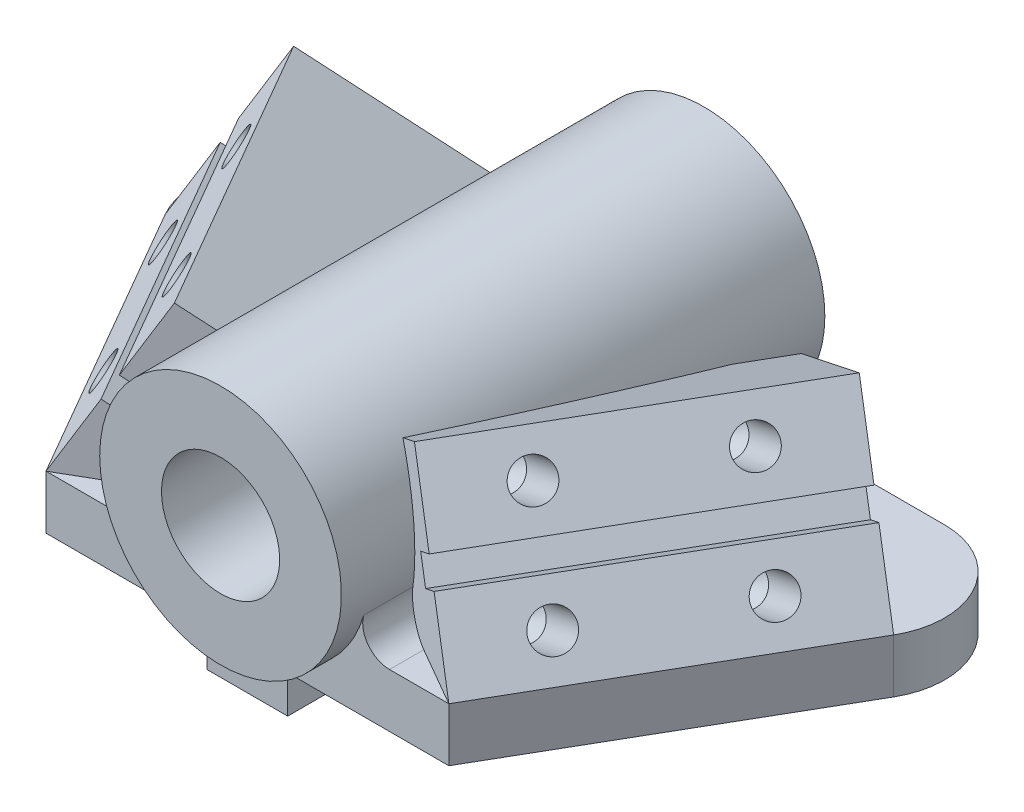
ISO-10303-21;
HEADER;
FILE_DESCRIPTION(('STEP AP214'),'2;1');
FILE_NAME('part.step','',(''),(''),'','','');
FILE_SCHEMA(('AUTOMOTIVE_DESIGN { 1 0 10303 214 1 1 1 1 }'));
ENDSEC;
DATA;
#1=APPLICATION_CONTEXT('core data for automotive mechanical design processes');
#2=APPLICATION_PROTOCOL_DEFINITION('international standard','automotive_design',2000,#1);
#3=PRODUCT_CONTEXT('',#1,'mechanical');
#4=PRODUCT('Part','Part','',(#3));
#5=PRODUCT_RELATED_PRODUCT_CATEGORY('part','',(#4));
#6=PRODUCT_DEFINITION_FORMATION('','',#4);
#7=PRODUCT_DEFINITION_CONTEXT('part definition',#1,'design');
#8=PRODUCT_DEFINITION('design','',#6,#7);
#9=PRODUCT_DEFINITION_SHAPE('','',#8);
#10=(LENGTH_UNIT() NAMED_UNIT(*) SI_UNIT(.MILLI.,.METRE.));
#11=(NAMED_UNIT(*) PLANE_ANGLE_UNIT() SI_UNIT($,.RADIAN.));
#12=(NAMED_UNIT(*) SI_UNIT($,.STERADIAN.) SOLID_ANGLE_UNIT());
#13=UNCERTAINTY_MEASURE_WITH_UNIT(LENGTH_MEASURE(1.E-05),#10,'distance_accuracy_value','');
#14=(GEOMETRIC_REPRESENTATION_CONTEXT(3) GLOBAL_UNCERTAINTY_ASSIGNED_CONTEXT((#13)) GLOBAL_UNIT_ASSIGNED_CONTEXT((#10,
#11,#12)) REPRESENTATION_CONTEXT('',''));
#15=CARTESIAN_POINT('',(0.,0.,0.));
#16=DIRECTION('',(0.,0.,1.));
#17=DIRECTION('',(1.,0.,0.));
#18=AXIS2_PLACEMENT_3D('',#15,#16,#17);
#19=CARTESIAN_POINT('',(-37.5,9.99999999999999,0.));
#20=DIRECTION('',(0.750000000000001,-0.500000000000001,-0.433012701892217));
#21=DIRECTION('',(-0.55470019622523,-0.832050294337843,0.));
#22=AXIS2_PLACEMENT_3D('',#19,#20,#21);
#23=PLANE('',#22);
#24=CARTESIAN_POINT('',(-56.9855715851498,16.4951905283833,-41.25));
#25=DIRECTION('',(-0.750000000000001,0.500000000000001,0.433012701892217));
#26=DIRECTION('',(-0.554700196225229,-0.832050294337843,0.));
#27=AXIS2_PLACEMENT_3D('',#24,#25,#26);
#28=CIRCLE('',#27,3.5);
#29=CARTESIAN_POINT('',(-58.9270222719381,13.5830144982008,-41.25));
#30=VERTEX_POINT('',#29);
#31=EDGE_CURVE('E290',#30,#30,#28,.T.);
#32=ORIENTED_EDGE('',*,*,#31,.F.);
#33=EDGE_LOOP('',(#32));
#34=FACE_BOUND('',#33,.T.);
#35=CARTESIAN_POINT('',(-41.8301270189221,16.4951905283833,-15.));
#36=DIRECTION('',(-0.750000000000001,0.500000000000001,0.433012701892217));
#37=DIRECTION('',(-0.554700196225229,-0.832050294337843,0.));
#38=AXIS2_PLACEMENT_3D('',#35,#36,#37);
#39=CIRCLE('',#38,3.5);
#40=CARTESIAN_POINT('',(-43.7715777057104,13.5830144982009,-15.));
#41=VERTEX_POINT('',#40);
#42=EDGE_CURVE('E296',#41,#41,#39,.T.);
#43=ORIENTED_EDGE('',*,*,#42,.F.);
#44=EDGE_LOOP('',(#43));
#45=FACE_BOUND('',#44,.T.);
#46=DIRECTION('',(-0.499999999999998,0.,-0.86602540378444));
#47=VECTOR('',#46,1.);
#48=CARTESIAN_POINT('',(-31.0048094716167,22.9903810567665,-3.74999999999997));
#49=LINE('',#48,#47);
#50=CARTESIAN_POINT('',(-31.0048094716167,22.9903810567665,-3.74999999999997));
#51=VERTEX_POINT('',#50);
#52=CARTESIAN_POINT('',(-61.3156986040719,22.9903810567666,-56.25));
#53=VERTEX_POINT('',#52);
#54=EDGE_CURVE('E302',#51,#53,#49,.T.);
#55=ORIENTED_EDGE('',*,*,#54,.T.);
#56=DIRECTION('',(0.433012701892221,0.866025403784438,-0.25));
#57=VECTOR('',#56,1.);
#58=CARTESIAN_POINT('',(-67.8108891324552,9.99999999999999,-52.5));
#59=LINE('',#58,#57);
#60=CARTESIAN_POINT('',(-67.8108891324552,9.99999999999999,-52.5));
#61=VERTEX_POINT('',#60);
#62=EDGE_CURVE('E408',#61,#53,#59,.T.);
#63=ORIENTED_EDGE('',*,*,#62,.F.);
#64=DIRECTION('',(0.499999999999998,0.,0.86602540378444));
#65=VECTOR('',#64,1.);
#66=CARTESIAN_POINT('',(-37.5,10.,0.));
#67=LINE('',#66,#65);
#68=CARTESIAN_POINT('',(-37.5,9.99999999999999,0.));
#69=VERTEX_POINT('',#68);
#70=EDGE_CURVE('E512',#61,#69,#67,.T.);
#71=ORIENTED_EDGE('',*,*,#70,.T.);
#72=DIRECTION('',(-0.433012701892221,-0.866025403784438,0.249999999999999));
#73=VECTOR('',#72,1.);
#74=CARTESIAN_POINT('',(-22.3445554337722,40.3108891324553,-8.74999999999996));
#75=LINE('',#74,#73);
#76=EDGE_CURVE('E394',#51,#69,#75,.T.);
#77=ORIENTED_EDGE('',*,*,#76,.F.);
#78=EDGE_LOOP('',(#55,#63,#71,#77));
#79=FACE_BOUND('',#78,.T.);
#80=ADVANCED_FACE('F37',(#34,#45,#79),#23,.F.);
#81=CARTESIAN_POINT('',(-33.1698729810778,33.815698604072,-20.));
#82=DIRECTION('',(-0.750000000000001,0.500000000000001,0.433012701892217));
#83=DIRECTION('',(-0.554700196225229,-0.832050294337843,0.));
#84=AXIS2_PLACEMENT_3D('',#81,#82,#83);
#85=CIRCLE('',#84,3.49999999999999);
#86=CARTESIAN_POINT('',(-35.111323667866,30.9035225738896,-20.));
#87=VERTEX_POINT('',#86);
#88=EDGE_CURVE('E280',#87,#87,#85,.T.);
#89=ORIENTED_EDGE('',*,*,#88,.F.);
#90=EDGE_LOOP('',(#89));
#91=FACE_BOUND('',#90,.T.);
#92=CARTESIAN_POINT('',(-48.3253175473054,33.815698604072,-46.25));
#93=DIRECTION('',(-0.750000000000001,0.500000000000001,0.433012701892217));
#94=DIRECTION('',(-0.554700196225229,-0.832050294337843,0.));
#95=AXIS2_PLACEMENT_3D('',#92,#93,#94);
#96=CIRCLE('',#95,3.5);
#97=CARTESIAN_POINT('',(-50.2667682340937,30.9035225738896,-46.25));
#98=VERTEX_POINT('',#97);
#99=EDGE_CURVE('E279',#98,#98,#96,.T.);
#100=ORIENTED_EDGE('',*,*,#99,.F.);
#101=EDGE_LOOP('',(#100));
#102=FACE_BOUND('',#101,.T.);
#103=DIRECTION('',(0.499999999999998,0.,0.86602540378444));
#104=VECTOR('',#103,1.);
#105=CARTESIAN_POINT('',(-28.8397459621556,27.3205080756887,-4.99999999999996));
#106=LINE('',#105,#104);
#107=CARTESIAN_POINT('',(-59.1506350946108,27.3205080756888,-57.5));
#108=VERTEX_POINT('',#107);
#109=CARTESIAN_POINT('',(-28.8397459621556,27.3205080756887,-4.99999999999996));
#110=VERTEX_POINT('',#109);
#111=EDGE_CURVE('E305',#108,#110,#106,.T.);
#112=ORIENTED_EDGE('',*,*,#111,.T.);
#113=CARTESIAN_POINT('',(-22.3445554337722,40.3108891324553,-8.74999999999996));
#114=VERTEX_POINT('',#113);
#115=EDGE_CURVE('E401',#114,#110,#75,.T.);
#116=ORIENTED_EDGE('',*,*,#115,.F.);
#117=DIRECTION('',(0.499999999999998,0.,0.86602540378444));
#118=VECTOR('',#117,1.);
#119=CARTESIAN_POINT('',(-52.6554445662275,40.3108891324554,-61.25));
#120=LINE('',#119,#118);
#121=CARTESIAN_POINT('',(-52.6554445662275,40.3108891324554,-61.25));
#122=VERTEX_POINT('',#121);
#123=EDGE_CURVE('E404',#122,#114,#120,.T.);
#124=ORIENTED_EDGE('',*,*,#123,.F.);
#125=EDGE_CURVE('E407',#108,#122,#59,.T.);
#126=ORIENTED_EDGE('',*,*,#125,.F.);
#127=EDGE_LOOP('',(#112,#116,#124,#126));
#128=FACE_BOUND('',#127,.T.);
#129=ADVANCED_FACE('F678',(#91,#102,#128),#23,.F.);
#130=CARTESIAN_POINT('',(3.1276507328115,23.3294183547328,-23.4563850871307));
#131=DIRECTION('',(-0.499999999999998,0.,-0.86602540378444));
#132=DIRECTION('',(-0.86602540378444,0.,0.499999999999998));
#133=AXIS2_PLACEMENT_3D('',#130,#131,#132);
#134=PLANE('',#133);
#135=DIRECTION('',(-0.750000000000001,0.500000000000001,0.433012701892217));
#136=VECTOR('',#135,1.);
#137=CARTESIAN_POINT('',(-27.2548094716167,20.4903810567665,-5.91506350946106));
#138=LINE('',#137,#136);
#139=CARTESIAN_POINT('',(-27.2548094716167,20.4903810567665,-5.91506350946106));
#140=VERTEX_POINT('',#139);
#141=EDGE_CURVE('E318',#140,#51,#138,.T.);
#142=ORIENTED_EDGE('',*,*,#141,.T.);
#143=ORIENTED_EDGE('',*,*,#76,.T.);
#144=DIRECTION('',(0.86602540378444,0.,-0.499999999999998));
#145=VECTOR('',#144,1.);
#146=CARTESIAN_POINT('',(-24.5096189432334,10.,-7.49999999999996));
#147=LINE('',#146,#145);
#148=CARTESIAN_POINT('',(-26.4575131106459,10.,-6.37538277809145));
#149=VERTEX_POINT('',#148);
#150=EDGE_CURVE('E434',#69,#149,#147,.T.);
#151=ORIENTED_EDGE('',*,*,#150,.T.);
#152=CARTESIAN_POINT('',(-26.4575131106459,15.,-6.37538277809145));
#153=DIRECTION('',(-0.499999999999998,0.,-0.86602540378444));
#154=DIRECTION('',(0.86602540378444,0.,-0.499999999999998));
#155=AXIS2_PLACEMENT_3D('',#152,#153,#154);
#156=ELLIPSE('',#155,5.77350269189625,5.);
#157=CARTESIAN_POINT('',(-21.6470561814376,16.3636363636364,-9.15270138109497));
#158=VERTEX_POINT('',#157);
#159=EDGE_CURVE('E430',#149,#158,#156,.F.);
#160=ORIENTED_EDGE('',*,*,#159,.T.);
#161=CARTESIAN_POINT('',(0.,22.5,-21.6506350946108));
#162=DIRECTION('',(-0.499999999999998,0.,-0.86602540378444));
#163=DIRECTION('',(0.86602540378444,0.,-0.499999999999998));
#164=AXIS2_PLACEMENT_3D('',#161,#162,#163);
#165=ELLIPSE('',#164,25.9807621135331,22.5);
#166=CARTESIAN_POINT('',(-17.2669163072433,36.9257963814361,-11.6815763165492));
#167=VERTEX_POINT('',#166);
#168=EDGE_CURVE('E432',#158,#167,#165,.T.);
#169=ORIENTED_EDGE('',*,*,#168,.T.);
#170=DIRECTION('',(-0.75,0.500000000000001,0.433012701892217));
#171=VECTOR('',#170,1.);
#172=CARTESIAN_POINT('',(3.1276507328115,23.3294183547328,-23.4563850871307));
#173=LINE('',#172,#171);
#174=EDGE_CURVE('E416',#167,#114,#173,.T.);
#175=ORIENTED_EDGE('',*,*,#174,.T.);
#176=ORIENTED_EDGE('',*,*,#115,.T.);
#177=DIRECTION('',(-0.750000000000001,0.500000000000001,0.433012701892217));
#178=VECTOR('',#177,1.);
#179=CARTESIAN_POINT('',(-25.0897459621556,24.8205080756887,-7.16506350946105));
#180=LINE('',#179,#178);
#181=CARTESIAN_POINT('',(-25.0897459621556,24.8205080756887,-7.16506350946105));
#182=VERTEX_POINT('',#181);
#183=EDGE_CURVE('E325',#182,#110,#180,.T.);
#184=ORIENTED_EDGE('',*,*,#183,.F.);
#185=DIRECTION('',(-0.433012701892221,-0.866025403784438,0.249999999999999));
#186=VECTOR('',#185,1.);
#187=CARTESIAN_POINT('',(-27.2548094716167,20.4903810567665,-5.91506350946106));
#188=LINE('',#187,#186);
#189=EDGE_CURVE('E311',#182,#140,#188,.T.);
#190=ORIENTED_EDGE('',*,*,#189,.T.);
#191=EDGE_LOOP('',(#142,#143,#151,#160,#169,#175,#176,#184,#190));
#192=FACE_BOUND('',#191,.T.);
#193=ADVANCED_FACE('F660',(#192),#134,.F.);
#194=CARTESIAN_POINT('',(-42.3386829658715,-6.98147077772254,-67.2063850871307));
#195=DIRECTION('',(0.499999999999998,0.,0.86602540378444));
#196=DIRECTION('',(0.86602540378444,0.,-0.499999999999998));
#197=AXIS2_PLACEMENT_3D('',#194,#195,#196);
#198=PLANE('',#197);
#199=DIRECTION('',(-0.750000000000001,0.500000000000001,0.433012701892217));
#200=VECTOR('',#199,1.);
#201=CARTESIAN_POINT('',(-57.5656986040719,20.4903810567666,-58.4150635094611));
#202=LINE('',#201,#200);
#203=CARTESIAN_POINT('',(-57.5656986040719,20.4903810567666,-58.4150635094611));
#204=VERTEX_POINT('',#203);
#205=EDGE_CURVE('E319',#204,#53,#202,.T.);
#206=ORIENTED_EDGE('',*,*,#205,.F.);
#207=DIRECTION('',(0.433012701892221,0.866025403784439,-0.249999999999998));
#208=VECTOR('',#207,1.);
#209=CARTESIAN_POINT('',(-55.4006350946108,24.8205080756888,-59.6650635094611));
#210=LINE('',#209,#208);
#211=CARTESIAN_POINT('',(-55.4006350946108,24.8205080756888,-59.6650635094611));
#212=VERTEX_POINT('',#211);
#213=EDGE_CURVE('E315',#204,#212,#210,.T.);
#214=ORIENTED_EDGE('',*,*,#213,.T.);
#215=DIRECTION('',(-0.750000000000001,0.500000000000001,0.433012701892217));
#216=VECTOR('',#215,1.);
#217=CARTESIAN_POINT('',(-55.4006350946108,24.8205080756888,-59.6650635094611));
#218=LINE('',#217,#216);
#219=EDGE_CURVE('E322',#212,#108,#218,.T.);
#220=ORIENTED_EDGE('',*,*,#219,.T.);
#221=ORIENTED_EDGE('',*,*,#125,.T.);
#222=DIRECTION('',(-0.75,0.500000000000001,0.433012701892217));
#223=VECTOR('',#222,1.);
#224=CARTESIAN_POINT('',(-27.1832383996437,23.3294183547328,-75.9563850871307));
#225=LINE('',#224,#223);
#226=CARTESIAN_POINT('',(-27.1832383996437,23.3294183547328,-75.9563850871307));
#227=VERTEX_POINT('',#226);
#228=EDGE_CURVE('E417',#227,#122,#225,.T.);
#229=ORIENTED_EDGE('',*,*,#228,.F.);
#230=DIRECTION('',(0.433012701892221,0.866025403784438,-0.25));
#231=VECTOR('',#230,1.);
#232=CARTESIAN_POINT('',(-42.3386829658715,-6.98147077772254,-67.2063850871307));
#233=LINE('',#232,#231);
#234=CARTESIAN_POINT('',(-33.8479475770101,10.,-72.1085134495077));
#235=VERTEX_POINT('',#234);
#236=EDGE_CURVE('E414',#235,#227,#233,.T.);
#237=ORIENTED_EDGE('',*,*,#236,.F.);
#238=DIRECTION('',(-0.86602540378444,0.,0.499999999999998));
#239=VECTOR('',#238,1.);
#240=CARTESIAN_POINT('',(-54.8205080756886,10.,-60.));
#241=LINE('',#240,#239);
#242=EDGE_CURVE('E438',#235,#61,#241,.T.);
#243=ORIENTED_EDGE('',*,*,#242,.T.);
#244=ORIENTED_EDGE('',*,*,#62,.T.);
#245=EDGE_LOOP('',(#206,#214,#220,#221,#229,#237,#243,#244));
#246=FACE_BOUND('',#245,.T.);
#247=ADVANCED_FACE('F673',(#246),#198,.F.);
#248=CARTESIAN_POINT('',(37.5,9.99999999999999,0.));
#249=DIRECTION('',(-0.750000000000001,-0.500000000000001,-0.433012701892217));
#250=DIRECTION('',(0.55470019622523,-0.832050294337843,0.));
#251=AXIS2_PLACEMENT_3D('',#248,#249,#250);
#252=PLANE('',#251);
#253=CARTESIAN_POINT('',(56.9855715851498,16.4951905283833,-41.25));
#254=DIRECTION('',(0.750000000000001,0.500000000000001,0.433012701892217));
#255=DIRECTION('',(-0.554700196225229,0.832050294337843,0.));
#256=AXIS2_PLACEMENT_3D('',#253,#254,#255);
#257=CIRCLE('',#256,3.5);
#258=CARTESIAN_POINT('',(55.0441208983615,19.4073665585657,-41.25));
#259=VERTEX_POINT('',#258);
#260=EDGE_CURVE('E343',#259,#259,#257,.T.);
#261=ORIENTED_EDGE('',*,*,#260,.F.);
#262=EDGE_LOOP('',(#261));
#263=FACE_BOUND('',#262,.T.);
#264=CARTESIAN_POINT('',(41.8301270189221,16.4951905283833,-15.));
#265=DIRECTION('',(0.750000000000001,0.500000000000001,0.433012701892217));
#266=DIRECTION('',(-0.554700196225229,0.832050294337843,0.));
#267=AXIS2_PLACEMENT_3D('',#264,#265,#266);
#268=CIRCLE('',#267,3.5);
#269=CARTESIAN_POINT('',(39.8886763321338,19.4073665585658,-15.));
#270=VERTEX_POINT('',#269);
#271=EDGE_CURVE('E349',#270,#270,#268,.T.);
#272=ORIENTED_EDGE('',*,*,#271,.F.);
#273=EDGE_LOOP('',(#272));
#274=FACE_BOUND('',#273,.T.);
#275=DIRECTION('',(-0.433012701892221,0.866025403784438,-0.25));
#276=VECTOR('',#275,1.);
#277=CARTESIAN_POINT('',(67.8108891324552,9.99999999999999,-52.5));
#278=LINE('',#277,#276);
#279=CARTESIAN_POINT('',(67.8108891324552,9.99999999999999,-52.5));
#280=VERTEX_POINT('',#279);
#281=CARTESIAN_POINT('',(61.3156986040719,22.9903810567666,-56.25));
#282=VERTEX_POINT('',#281);
#283=EDGE_CURVE('E441',#280,#282,#278,.T.);
#284=ORIENTED_EDGE('',*,*,#283,.T.);
#285=DIRECTION('',(0.499999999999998,0.,-0.86602540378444));
#286=VECTOR('',#285,1.);
#287=CARTESIAN_POINT('',(31.0048094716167,22.9903810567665,-3.74999999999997));
#288=LINE('',#287,#286);
#289=CARTESIAN_POINT('',(31.0048094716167,22.9903810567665,-3.74999999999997));
#290=VERTEX_POINT('',#289);
#291=EDGE_CURVE('E352',#290,#282,#288,.T.);
#292=ORIENTED_EDGE('',*,*,#291,.F.);
#293=DIRECTION('',(0.433012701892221,-0.866025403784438,0.249999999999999));
#294=VECTOR('',#293,1.);
#295=CARTESIAN_POINT('',(22.3445554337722,40.3108891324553,-8.74999999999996));
#296=LINE('',#295,#294);
#297=CARTESIAN_POINT('',(37.5,9.99999999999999,0.));
#298=VERTEX_POINT('',#297);
#299=EDGE_CURVE('E447',#290,#298,#296,.T.);
#300=ORIENTED_EDGE('',*,*,#299,.T.);
#301=DIRECTION('',(0.499999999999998,0.,-0.86602540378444));
#302=VECTOR('',#301,1.);
#303=CARTESIAN_POINT('',(37.5,10.,0.));
#304=LINE('',#303,#302);
#305=EDGE_CURVE('E519',#298,#280,#304,.T.);
#306=ORIENTED_EDGE('',*,*,#305,.T.);
#307=EDGE_LOOP('',(#284,#292,#300,#306));
#308=FACE_BOUND('',#307,.T.);
#309=ADVANCED_FACE('F724',(#263,#274,#308),#252,.F.);
#310=CARTESIAN_POINT('',(-54.8205080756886,0.,-60.));
#311=DIRECTION('',(0.,-1.,0.));
#312=DIRECTION('',(0.,0.,-1.));
#313=AXIS2_PLACEMENT_3D('',#310,#311,#312);
#314=PLANE('',#313);
#315=DIRECTION('',(0.,0.,1.));
#316=VECTOR('',#315,1.);
#317=CARTESIAN_POINT('',(7.5,0.,-75.));
#318=LINE('',#317,#316);
#319=CARTESIAN_POINT('',(7.5,0.,-75.));
#320=VERTEX_POINT('',#319);
#321=CARTESIAN_POINT('',(7.5,0.,0.));
#322=VERTEX_POINT('',#321);
#323=EDGE_CURVE('E391',#320,#322,#318,.T.);
#324=ORIENTED_EDGE('',*,*,#323,.F.);
#325=DIRECTION('',(-1.,0.,0.));
#326=VECTOR('',#325,1.);
#327=CARTESIAN_POINT('',(54.8205080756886,0.,-75.));
#328=LINE('',#327,#326);
#329=CARTESIAN_POINT('',(54.8205080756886,0.,-75.));
#330=VERTEX_POINT('',#329);
#331=EDGE_CURVE('E507',#330,#320,#328,.T.);
#332=ORIENTED_EDGE('',*,*,#331,.F.);
#333=CARTESIAN_POINT('',(54.8205080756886,0.,-60.));
#334=DIRECTION('',(0.,1.,0.));
#335=DIRECTION('',(0.,0.,1.));
#336=AXIS2_PLACEMENT_3D('',#333,#334,#335);
#337=CIRCLE('',#336,15.);
#338=CARTESIAN_POINT('',(67.8108891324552,0.,-52.5));
#339=VERTEX_POINT('',#338);
#340=EDGE_CURVE('E504',#339,#330,#337,.T.);
#341=ORIENTED_EDGE('',*,*,#340,.F.);
#342=DIRECTION('',(0.499999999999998,0.,-0.86602540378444));
#343=VECTOR('',#342,1.);
#344=CARTESIAN_POINT('',(37.5,0.,0.));
#345=LINE('',#344,#343);
#346=CARTESIAN_POINT('',(37.5,0.,0.));
#347=VERTEX_POINT('',#346);
#348=EDGE_CURVE('E502',#347,#339,#345,.T.);
#349=ORIENTED_EDGE('',*,*,#348,.F.);
#350=DIRECTION('',(1.,0.,0.));
#351=VECTOR('',#350,1.);
#352=CARTESIAN_POINT('',(-37.5,0.,0.));
#353=LINE('',#352,#351);
#354=EDGE_CURVE('E498',#322,#347,#353,.T.);
#355=ORIENTED_EDGE('',*,*,#354,.F.);
#356=EDGE_LOOP('',(#324,#332,#341,#349,#355));
#357=FACE_BOUND('',#356,.T.);
#358=ADVANCED_FACE('F618',(#357),#314,.T.);
#359=CARTESIAN_POINT('',(-54.8205080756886,10.,-60.));
#360=DIRECTION('',(0.,-1.,0.));
#361=DIRECTION('',(0.,0.,-1.));
#362=AXIS2_PLACEMENT_3D('',#359,#360,#361);
#363=PLANE('',#362);
#364=ORIENTED_EDGE('',*,*,#150,.F.);
#365=DIRECTION('',(1.,0.,0.));
#366=VECTOR('',#365,1.);
#367=CARTESIAN_POINT('',(-37.5,10.,0.));
#368=LINE('',#367,#366);
#369=CARTESIAN_POINT('',(-26.4575131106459,10.,0.));
#370=VERTEX_POINT('',#369);
#371=EDGE_CURVE('E516',#69,#370,#368,.T.);
#372=ORIENTED_EDGE('',*,*,#371,.T.);
#373=DIRECTION('',(0.,0.,1.));
#374=VECTOR('',#373,1.);
#375=CARTESIAN_POINT('',(-26.4575131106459,10.,-75.));
#376=LINE('',#375,#374);
#377=EDGE_CURVE('E558',#370,#149,#376,.F.);
#378=ORIENTED_EDGE('',*,*,#377,.T.);
#379=EDGE_LOOP('',(#364,#372,#378));
#380=FACE_BOUND('',#379,.T.);
#381=ADVANCED_FACE('F649',(#380),#363,.F.);
#382=ORIENTED_EDGE('',*,*,#242,.F.);
#383=DIRECTION('',(0.499999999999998,0.,0.86602540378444));
#384=VECTOR('',#383,1.);
#385=CARTESIAN_POINT('',(-33.8479475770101,10.,-72.1085134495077));
#386=LINE('',#385,#384);
#387=CARTESIAN_POINT('',(-26.4575131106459,10.,-59.3079054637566));
#388=VERTEX_POINT('',#387);
#389=EDGE_CURVE('E427',#235,#388,#386,.T.);
#390=ORIENTED_EDGE('',*,*,#389,.T.);
#391=CARTESIAN_POINT('',(-26.4575131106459,10.,-75.));
#392=VERTEX_POINT('',#391);
#393=EDGE_CURVE('E557',#388,#392,#376,.F.);
#394=ORIENTED_EDGE('',*,*,#393,.T.);
#395=DIRECTION('',(-1.,0.,0.));
#396=VECTOR('',#395,1.);
#397=CARTESIAN_POINT('',(54.8205080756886,10.,-75.));
#398=LINE('',#397,#396);
#399=CARTESIAN_POINT('',(-54.8205080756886,10.,-75.));
#400=VERTEX_POINT('',#399);
#401=EDGE_CURVE('E524',#392,#400,#398,.T.);
#402=ORIENTED_EDGE('',*,*,#401,.T.);
#403=CARTESIAN_POINT('',(-54.8205080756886,10.,-60.));
#404=DIRECTION('',(0.,1.,0.));
#405=DIRECTION('',(0.,0.,-1.));
#406=AXIS2_PLACEMENT_3D('',#403,#404,#405);
#407=CIRCLE('',#406,15.);
#408=EDGE_CURVE('E528',#400,#61,#407,.T.);
#409=ORIENTED_EDGE('',*,*,#408,.T.);
#410=EDGE_LOOP('',(#382,#390,#394,#402,#409));
#411=FACE_BOUND('',#410,.T.);
#412=ADVANCED_FACE('F687',(#411),#363,.F.);
#413=DIRECTION('',(0.,0.,1.));
#414=VECTOR('',#413,1.);
#415=CARTESIAN_POINT('',(-7.5,0.,-75.));
#416=LINE('',#415,#414);
#417=CARTESIAN_POINT('',(-7.49999999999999,0.,-75.));
#418=VERTEX_POINT('',#417);
#419=CARTESIAN_POINT('',(-7.5,0.,0.));
#420=VERTEX_POINT('',#419);
#421=EDGE_CURVE('E397',#418,#420,#416,.T.);
#422=ORIENTED_EDGE('',*,*,#421,.T.);
#423=CARTESIAN_POINT('',(-37.5,0.,0.));
#424=VERTEX_POINT('',#423);
#425=EDGE_CURVE('E499',#424,#420,#353,.T.);
#426=ORIENTED_EDGE('',*,*,#425,.F.);
#427=DIRECTION('',(0.499999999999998,0.,0.86602540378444));
#428=VECTOR('',#427,1.);
#429=CARTESIAN_POINT('',(-37.5,0.,0.));
#430=LINE('',#429,#428);
#431=CARTESIAN_POINT('',(-67.8108891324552,0.,-52.5));
#432=VERTEX_POINT('',#431);
#433=EDGE_CURVE('E495',#432,#424,#430,.T.);
#434=ORIENTED_EDGE('',*,*,#433,.F.);
#435=CARTESIAN_POINT('',(-54.8205080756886,0.,-60.));
#436=DIRECTION('',(0.,1.,0.));
#437=DIRECTION('',(0.,0.,-1.));
#438=AXIS2_PLACEMENT_3D('',#435,#436,#437);
#439=CIRCLE('',#438,15.);
#440=CARTESIAN_POINT('',(-54.8205080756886,0.,-75.));
#441=VERTEX_POINT('',#440);
#442=EDGE_CURVE('E510',#441,#432,#439,.T.);
#443=ORIENTED_EDGE('',*,*,#442,.F.);
#444=EDGE_CURVE('E506',#418,#441,#328,.T.);
#445=ORIENTED_EDGE('',*,*,#444,.F.);
#446=EDGE_LOOP('',(#422,#426,#434,#443,#445));
#447=FACE_BOUND('',#446,.T.);
#448=ADVANCED_FACE('F639',(#447),#314,.T.);
#449=CARTESIAN_POINT('',(0.,22.5,73.6396103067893));
#450=DIRECTION('',(0.,0.,-1.));
#451=DIRECTION('',(-1.,0.,0.));
#452=AXIS2_PLACEMENT_3D('',#449,#450,#451);
#453=CYLINDRICAL_SURFACE('',#452,22.5);
#454=CARTESIAN_POINT('',(0.,22.5,-85.));
#455=DIRECTION('',(0.,0.,1.));
#456=DIRECTION('',(1.,0.,0.));
#457=AXIS2_PLACEMENT_3D('',#454,#455,#456);
#458=CIRCLE('',#457,22.5);
#459=CARTESIAN_POINT('',(22.5,22.5,-85.));
#460=VERTEX_POINT('',#459);
#461=EDGE_CURVE('E480',#460,#460,#458,.F.);
#462=ORIENTED_EDGE('',*,*,#461,.F.);
#463=EDGE_LOOP('',(#462));
#464=FACE_BOUND('',#463,.T.);
#465=CARTESIAN_POINT('',(0.,22.5,5.));
#466=DIRECTION('',(0.,0.,-1.));
#467=DIRECTION('',(-1.,0.,0.));
#468=AXIS2_PLACEMENT_3D('',#465,#466,#467);
#469=CIRCLE('',#468,22.5);
#470=CARTESIAN_POINT('',(-22.5,22.5,5.));
#471=VERTEX_POINT('',#470);
#472=EDGE_CURVE('E483',#471,#471,#469,.T.);
#473=ORIENTED_EDGE('',*,*,#472,.T.);
#474=EDGE_LOOP('',(#473));
#475=FACE_BOUND('',#474,.T.);
#476=ORIENTED_EDGE('',*,*,#168,.F.);
#477=DIRECTION('',(0.,0.,-1.));
#478=VECTOR('',#477,1.);
#479=CARTESIAN_POINT('',(-21.6470561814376,16.3636363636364,73.6396103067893));
#480=LINE('',#479,#478);
#481=CARTESIAN_POINT('',(-21.6470561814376,16.3636363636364,0.));
#482=VERTEX_POINT('',#481);
#483=EDGE_CURVE('E553',#158,#482,#480,.F.);
#484=ORIENTED_EDGE('',*,*,#483,.T.);
#485=CARTESIAN_POINT('',(0.,22.5,0.));
#486=DIRECTION('',(0.,0.,-1.));
#487=DIRECTION('',(-1.,0.,0.));
#488=AXIS2_PLACEMENT_3D('',#485,#486,#487);
#489=CIRCLE('',#488,22.5);
#490=CARTESIAN_POINT('',(21.6470561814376,16.3636363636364,0.));
#491=VERTEX_POINT('',#490);
#492=EDGE_CURVE('E493',#482,#491,#489,.F.);
#493=ORIENTED_EDGE('',*,*,#492,.T.);
#494=DIRECTION('',(0.,0.,-1.));
#495=VECTOR('',#494,1.);
#496=CARTESIAN_POINT('',(21.6470561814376,16.3636363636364,73.6396103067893));
#497=LINE('',#496,#495);
#498=CARTESIAN_POINT('',(21.6470561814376,16.3636363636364,-9.15270138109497));
#499=VERTEX_POINT('',#498);
#500=EDGE_CURVE('E550',#491,#499,#497,.T.);
#501=ORIENTED_EDGE('',*,*,#500,.T.);
#502=CARTESIAN_POINT('',(0.,22.5,-21.6506350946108));
#503=DIRECTION('',(-0.499999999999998,0.,0.86602540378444));
#504=DIRECTION('',(-0.86602540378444,0.,-0.499999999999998));
#505=AXIS2_PLACEMENT_3D('',#502,#503,#504);
#506=ELLIPSE('',#505,25.9807621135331,22.5);
#507=CARTESIAN_POINT('',(17.2669163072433,36.9257963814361,-11.6815763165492));
#508=VERTEX_POINT('',#507);
#509=EDGE_CURVE('E467',#499,#508,#506,.T.);
#510=ORIENTED_EDGE('',*,*,#509,.T.);
#511=CARTESIAN_POINT('',(0.,22.5,-31.746824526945));
#512=DIRECTION('',(-0.433012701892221,0.866025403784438,-0.249999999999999));
#513=DIRECTION('',(0.11180339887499,-0.223606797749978,-0.968245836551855));
#514=AXIS2_PLACEMENT_3D('',#511,#512,#513);
#515=ELLIPSE('',#514,90.0000000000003,22.5);
#516=CARTESIAN_POINT('',(22.4847073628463,23.3294183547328,-67.8182906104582));
#517=VERTEX_POINT('',#516);
#518=EDGE_CURVE('E473',#508,#517,#515,.T.);
#519=ORIENTED_EDGE('',*,*,#518,.T.);
#520=CARTESIAN_POINT('',(0.,22.5,-27.9159052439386));
#521=DIRECTION('',(-0.750000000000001,-0.500000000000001,-0.433012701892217));
#522=DIRECTION('',(0.360288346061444,0.24019223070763,-0.901387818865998));
#523=AXIS2_PLACEMENT_3D('',#520,#521,#522);
#524=ELLIPSE('',#523,51.9615242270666,22.5);
#525=CARTESIAN_POINT('',(21.6470561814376,16.3636363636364,-58.3240439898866));
#526=VERTEX_POINT('',#525);
#527=EDGE_CURVE('E459',#517,#526,#524,.T.);
#528=ORIENTED_EDGE('',*,*,#527,.T.);
#529=CARTESIAN_POINT('',(21.6470561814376,16.3636363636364,-75.));
#530=VERTEX_POINT('',#529);
#531=EDGE_CURVE('E549',#526,#530,#497,.T.);
#532=ORIENTED_EDGE('',*,*,#531,.T.);
#533=CARTESIAN_POINT('',(0.,22.5,-75.));
#534=DIRECTION('',(0.,0.,1.));
#535=DIRECTION('',(1.,0.,0.));
#536=AXIS2_PLACEMENT_3D('',#533,#534,#535);
#537=CIRCLE('',#536,22.5);
#538=CARTESIAN_POINT('',(-21.6470561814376,16.3636363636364,-75.));
#539=VERTEX_POINT('',#538);
#540=EDGE_CURVE('E491',#530,#539,#537,.F.);
#541=ORIENTED_EDGE('',*,*,#540,.T.);
#542=CARTESIAN_POINT('',(-21.6470561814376,16.3636363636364,-58.3240439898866));
#543=VERTEX_POINT('',#542);
#544=EDGE_CURVE('E554',#539,#543,#480,.F.);
#545=ORIENTED_EDGE('',*,*,#544,.T.);
#546=CARTESIAN_POINT('',(0.,22.5,-27.9159052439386));
#547=DIRECTION('',(0.750000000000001,-0.500000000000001,-0.433012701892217));
#548=DIRECTION('',(-0.360288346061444,0.24019223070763,-0.901387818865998));
#549=AXIS2_PLACEMENT_3D('',#546,#547,#548);
#550=ELLIPSE('',#549,51.9615242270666,22.5);
#551=CARTESIAN_POINT('',(-22.4847073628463,23.3294183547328,-67.8182906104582));
#552=VERTEX_POINT('',#551);
#553=EDGE_CURVE('E424',#543,#552,#550,.T.);
#554=ORIENTED_EDGE('',*,*,#553,.T.);
#555=CARTESIAN_POINT('',(0.,22.5,-31.746824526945));
#556=DIRECTION('',(-0.433012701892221,-0.866025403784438,0.249999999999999));
#557=DIRECTION('',(-0.11180339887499,-0.223606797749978,-0.968245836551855));
#558=AXIS2_PLACEMENT_3D('',#555,#556,#557);
#559=ELLIPSE('',#558,90.0000000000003,22.5);
#560=EDGE_CURVE('E436',#167,#552,#559,.T.);
#561=ORIENTED_EDGE('',*,*,#560,.F.);
#562=EDGE_LOOP('',(#476,#484,#493,#501,#510,#519,#528,#532,#541,#545,#554,#561));
#563=FACE_BOUND('',#562,.T.);
#564=ADVANCED_FACE('F595',(#464,#475,#563),#453,.T.);
#565=CARTESIAN_POINT('',(0.,22.5,73.6396103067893));
#566=DIRECTION('',(0.,0.,-1.));
#567=DIRECTION('',(-1.,0.,0.));
#568=AXIS2_PLACEMENT_3D('',#565,#566,#567);
#569=CYLINDRICAL_SURFACE('',#568,11.);
#570=CARTESIAN_POINT('',(0.,22.5,5.));
#571=DIRECTION('',(0.,0.,-1.));
#572=DIRECTION('',(-1.,0.,0.));
#573=AXIS2_PLACEMENT_3D('',#570,#571,#572);
#574=CIRCLE('',#573,11.);
#575=CARTESIAN_POINT('',(-11.,22.5,5.));
#576=VERTEX_POINT('',#575);
#577=EDGE_CURVE('E488',#576,#576,#574,.T.);
#578=ORIENTED_EDGE('',*,*,#577,.F.);
#579=EDGE_LOOP('',(#578));
#580=FACE_BOUND('',#579,.T.);
#581=CARTESIAN_POINT('',(0.,22.5,-85.));
#582=DIRECTION('',(0.,0.,1.));
#583=DIRECTION('',(1.,0.,0.));
#584=AXIS2_PLACEMENT_3D('',#581,#582,#583);
#585=CIRCLE('',#584,11.);
#586=CARTESIAN_POINT('',(11.,22.5,-85.));
#587=VERTEX_POINT('',#586);
#588=EDGE_CURVE('E479',#587,#587,#585,.F.);
#589=ORIENTED_EDGE('',*,*,#588,.T.);
#590=EDGE_LOOP('',(#589));
#591=FACE_BOUND('',#590,.T.);
#592=ADVANCED_FACE('F706',(#580,#591),#569,.F.);
#593=CARTESIAN_POINT('',(-26.4575131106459,15.,73.6396103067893));
#594=DIRECTION('',(0.,0.,-1.));
#595=DIRECTION('',(-1.,0.,0.));
#596=AXIS2_PLACEMENT_3D('',#593,#594,#595);
#597=CYLINDRICAL_SURFACE('',#596,5.);
#598=ORIENTED_EDGE('',*,*,#159,.F.);
#599=ORIENTED_EDGE('',*,*,#377,.F.);
#600=CARTESIAN_POINT('',(-26.4575131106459,15.,0.));
#601=DIRECTION('',(0.,0.,-1.));
#602=DIRECTION('',(-1.,0.,0.));
#603=AXIS2_PLACEMENT_3D('',#600,#601,#602);
#604=CIRCLE('',#603,5.);
#605=EDGE_CURVE('E565',#482,#370,#604,.T.);
#606=ORIENTED_EDGE('',*,*,#605,.F.);
#607=ORIENTED_EDGE('',*,*,#483,.F.);
#608=EDGE_LOOP('',(#598,#599,#606,#607));
#609=FACE_BOUND('',#608,.T.);
#610=ADVANCED_FACE('F659',(#609),#597,.F.);
#611=CARTESIAN_POINT('',(26.4575131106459,10.,0.));
#612=VERTEX_POINT('',#611);
#613=EDGE_CURVE('E515',#612,#298,#368,.T.);
#614=ORIENTED_EDGE('',*,*,#613,.T.);
#615=DIRECTION('',(-0.86602540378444,0.,-0.499999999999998));
#616=VECTOR('',#615,1.);
#617=CARTESIAN_POINT('',(-57.7211431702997,10.,-54.9759526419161));
#618=LINE('',#617,#616);
#619=CARTESIAN_POINT('',(26.4575131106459,10.,-6.37538277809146));
#620=VERTEX_POINT('',#619);
#621=EDGE_CURVE('E470',#298,#620,#618,.T.);
#622=ORIENTED_EDGE('',*,*,#621,.T.);
#623=DIRECTION('',(0.,0.,1.));
#624=VECTOR('',#623,1.);
#625=CARTESIAN_POINT('',(26.4575131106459,10.,0.));
#626=LINE('',#625,#624);
#627=EDGE_CURVE('E561',#620,#612,#626,.T.);
#628=ORIENTED_EDGE('',*,*,#627,.T.);
#629=EDGE_LOOP('',(#614,#622,#628));
#630=FACE_BOUND('',#629,.T.);
#631=ADVANCED_FACE('F705',(#630),#363,.F.);
#632=CARTESIAN_POINT('',(26.4575131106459,15.,73.6396103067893));
#633=DIRECTION('',(0.,0.,-1.));
#634=DIRECTION('',(-1.,0.,0.));
#635=AXIS2_PLACEMENT_3D('',#632,#633,#634);
#636=CYLINDRICAL_SURFACE('',#635,5.);
#637=ORIENTED_EDGE('',*,*,#627,.F.);
#638=CARTESIAN_POINT('',(26.4575131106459,15.,-6.37538277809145));
#639=DIRECTION('',(-0.499999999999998,0.,0.86602540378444));
#640=DIRECTION('',(-0.86602540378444,0.,-0.499999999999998));
#641=AXIS2_PLACEMENT_3D('',#638,#639,#640);
#642=ELLIPSE('',#641,5.77350269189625,5.);
#643=EDGE_CURVE('E12',#620,#499,#642,.F.);
#644=ORIENTED_EDGE('',*,*,#643,.T.);
#645=ORIENTED_EDGE('',*,*,#500,.F.);
#646=CARTESIAN_POINT('',(26.4575131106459,15.,0.));
#647=DIRECTION('',(0.,0.,-1.));
#648=DIRECTION('',(-1.,0.,0.));
#649=AXIS2_PLACEMENT_3D('',#646,#647,#648);
#650=CIRCLE('',#649,5.);
#651=EDGE_CURVE('E572',#612,#491,#650,.T.);
#652=ORIENTED_EDGE('',*,*,#651,.F.);
#653=EDGE_LOOP('',(#637,#644,#645,#652));
#654=FACE_BOUND('',#653,.T.);
#655=ADVANCED_FACE('F700',(#654),#636,.F.);
#656=CARTESIAN_POINT('',(-37.5,10.,0.));
#657=DIRECTION('',(0.,0.,-1.));
#658=DIRECTION('',(-1.,0.,0.));
#659=AXIS2_PLACEMENT_3D('',#656,#657,#658);
#660=PLANE('',#659);
#661=ORIENTED_EDGE('',*,*,#651,.T.);
#662=ORIENTED_EDGE('',*,*,#492,.F.);
#663=ORIENTED_EDGE('',*,*,#605,.T.);
#664=ORIENTED_EDGE('',*,*,#371,.F.);
#665=DIRECTION('',(0.,-1.,0.));
#666=VECTOR('',#665,1.);
#667=CARTESIAN_POINT('',(-37.5,10.,0.));
#668=LINE('',#667,#666);
#669=EDGE_CURVE('E546',#69,#424,#668,.T.);
#670=ORIENTED_EDGE('',*,*,#669,.T.);
#671=ORIENTED_EDGE('',*,*,#425,.T.);
#672=DIRECTION('',(0.,-1.,0.));
#673=VECTOR('',#672,1.);
#674=CARTESIAN_POINT('',(-7.5,0.,0.));
#675=LINE('',#674,#673);
#676=CARTESIAN_POINT('',(-7.5,-6.99999999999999,0.));
#677=VERTEX_POINT('',#676);
#678=EDGE_CURVE('E377',#420,#677,#675,.T.);
#679=ORIENTED_EDGE('',*,*,#678,.T.);
#680=DIRECTION('',(1.,0.,0.));
#681=VECTOR('',#680,1.);
#682=CARTESIAN_POINT('',(-7.5,-6.99999999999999,0.));
#683=LINE('',#682,#681);
#684=CARTESIAN_POINT('',(7.5,-7.,0.));
#685=VERTEX_POINT('',#684);
#686=EDGE_CURVE('E380',#677,#685,#683,.T.);
#687=ORIENTED_EDGE('',*,*,#686,.T.);
#688=DIRECTION('',(0.,1.,0.));
#689=VECTOR('',#688,1.);
#690=CARTESIAN_POINT('',(7.5,-7.,0.));
#691=LINE('',#690,#689);
#692=EDGE_CURVE('E367',#685,#322,#691,.T.);
#693=ORIENTED_EDGE('',*,*,#692,.T.);
#694=ORIENTED_EDGE('',*,*,#354,.T.);
#695=DIRECTION('',(0.,-1.,0.));
#696=VECTOR('',#695,1.);
#697=CARTESIAN_POINT('',(37.5,10.,0.));
#698=LINE('',#697,#696);
#699=EDGE_CURVE('E543',#298,#347,#698,.T.);
#700=ORIENTED_EDGE('',*,*,#699,.F.);
#701=ORIENTED_EDGE('',*,*,#613,.F.);
#702=EDGE_LOOP('',(#661,#662,#663,#664,#670,#671,#679,#687,#693,#694,#700,#701));
#703=FACE_BOUND('',#702,.T.);
#704=ADVANCED_FACE('F654',(#703),#660,.F.);
#705=CARTESIAN_POINT('',(54.8205080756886,10.,-75.));
#706=DIRECTION('',(0.,0.,1.));
#707=DIRECTION('',(1.,0.,0.));
#708=AXIS2_PLACEMENT_3D('',#705,#706,#707);
#709=PLANE('',#708);
#710=CARTESIAN_POINT('',(-26.4575131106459,15.,-75.));
#711=DIRECTION('',(0.,0.,1.));
#712=DIRECTION('',(1.,0.,0.));
#713=AXIS2_PLACEMENT_3D('',#710,#711,#712);
#714=CIRCLE('',#713,5.);
#715=EDGE_CURVE('E567',#392,#539,#714,.T.);
#716=ORIENTED_EDGE('',*,*,#715,.T.);
#717=ORIENTED_EDGE('',*,*,#540,.F.);
#718=CARTESIAN_POINT('',(26.4575131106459,15.,-75.));
#719=DIRECTION('',(0.,0.,1.));
#720=DIRECTION('',(1.,0.,0.));
#721=AXIS2_PLACEMENT_3D('',#718,#719,#720);
#722=CIRCLE('',#721,5.);
#723=CARTESIAN_POINT('',(26.4575131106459,10.,-75.));
#724=VERTEX_POINT('',#723);
#725=EDGE_CURVE('E570',#530,#724,#722,.T.);
#726=ORIENTED_EDGE('',*,*,#725,.T.);
#727=CARTESIAN_POINT('',(54.8205080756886,10.,-75.));
#728=VERTEX_POINT('',#727);
#729=EDGE_CURVE('E525',#728,#724,#398,.T.);
#730=ORIENTED_EDGE('',*,*,#729,.F.);
#731=DIRECTION('',(0.,-1.,0.));
#732=VECTOR('',#731,1.);
#733=CARTESIAN_POINT('',(54.8205080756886,10.,-75.));
#734=LINE('',#733,#732);
#735=EDGE_CURVE('E537',#728,#330,#734,.T.);
#736=ORIENTED_EDGE('',*,*,#735,.T.);
#737=ORIENTED_EDGE('',*,*,#331,.T.);
#738=DIRECTION('',(0.,1.,0.));
#739=VECTOR('',#738,1.);
#740=CARTESIAN_POINT('',(7.5,-7.,-75.));
#741=LINE('',#740,#739);
#742=CARTESIAN_POINT('',(7.5,-7.,-75.));
#743=VERTEX_POINT('',#742);
#744=EDGE_CURVE('E383',#743,#320,#741,.T.);
#745=ORIENTED_EDGE('',*,*,#744,.F.);
#746=DIRECTION('',(1.,0.,0.));
#747=VECTOR('',#746,1.);
#748=CARTESIAN_POINT('',(-7.5,-6.99999999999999,-75.));
#749=LINE('',#748,#747);
#750=CARTESIAN_POINT('',(-7.5,-6.99999999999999,-75.));
#751=VERTEX_POINT('',#750);
#752=EDGE_CURVE('E388',#751,#743,#749,.T.);
#753=ORIENTED_EDGE('',*,*,#752,.F.);
#754=DIRECTION('',(0.,-1.,0.));
#755=VECTOR('',#754,1.);
#756=CARTESIAN_POINT('',(-7.5,0.,-75.));
#757=LINE('',#756,#755);
#758=EDGE_CURVE('E385',#418,#751,#757,.T.);
#759=ORIENTED_EDGE('',*,*,#758,.F.);
#760=ORIENTED_EDGE('',*,*,#444,.T.);
#761=DIRECTION('',(0.,-1.,0.));
#762=VECTOR('',#761,1.);
#763=CARTESIAN_POINT('',(-54.8205080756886,10.,-75.));
#764=LINE('',#763,#762);
#765=EDGE_CURVE('E534',#400,#441,#764,.T.);
#766=ORIENTED_EDGE('',*,*,#765,.F.);
#767=ORIENTED_EDGE('',*,*,#401,.F.);
#768=EDGE_LOOP('',(#716,#717,#726,#730,#736,#737,#745,#753,#759,#760,#766,#767));
#769=FACE_BOUND('',#768,.T.);
#770=ADVANCED_FACE('F587',(#769),#709,.F.);
#771=DIRECTION('',(0.499999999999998,0.,-0.86602540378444));
#772=VECTOR('',#771,1.);
#773=CARTESIAN_POINT('',(6.43769353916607,10.,-24.6325608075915));
#774=LINE('',#773,#772);
#775=CARTESIAN_POINT('',(26.4575131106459,10.,-59.3079054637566));
#776=VERTEX_POINT('',#775);
#777=CARTESIAN_POINT('',(33.8479475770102,10.,-72.1085134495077));
#778=VERTEX_POINT('',#777);
#779=EDGE_CURVE('E464',#776,#778,#774,.T.);
#780=ORIENTED_EDGE('',*,*,#779,.T.);
#781=DIRECTION('',(0.86602540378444,0.,0.499999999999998));
#782=VECTOR('',#781,1.);
#783=CARTESIAN_POINT('',(-27.4102540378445,10.,-107.475952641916));
#784=LINE('',#783,#782);
#785=EDGE_CURVE('E476',#778,#280,#784,.T.);
#786=ORIENTED_EDGE('',*,*,#785,.T.);
#787=CARTESIAN_POINT('',(54.8205080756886,10.,-60.));
#788=DIRECTION('',(0.,1.,0.));
#789=DIRECTION('',(0.,0.,1.));
#790=AXIS2_PLACEMENT_3D('',#787,#788,#789);
#791=CIRCLE('',#790,15.);
#792=EDGE_CURVE('E522',#280,#728,#791,.T.);
#793=ORIENTED_EDGE('',*,*,#792,.T.);
#794=ORIENTED_EDGE('',*,*,#729,.T.);
#795=EDGE_CURVE('E562',#724,#776,#626,.T.);
#796=ORIENTED_EDGE('',*,*,#795,.T.);
#797=EDGE_LOOP('',(#780,#786,#793,#794,#796));
#798=FACE_BOUND('',#797,.T.);
#799=ADVANCED_FACE('F582',(#798),#363,.F.);
#800=CARTESIAN_POINT('',(-37.5,10.,0.));
#801=DIRECTION('',(0.86602540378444,0.,-0.499999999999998));
#802=DIRECTION('',(-0.499999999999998,0.,-0.86602540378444));
#803=AXIS2_PLACEMENT_3D('',#800,#801,#802);
#804=PLANE('',#803);
#805=ORIENTED_EDGE('',*,*,#433,.T.);
#806=ORIENTED_EDGE('',*,*,#669,.F.);
#807=ORIENTED_EDGE('',*,*,#70,.F.);
#808=DIRECTION('',(0.,-1.,0.));
#809=VECTOR('',#808,1.);
#810=CARTESIAN_POINT('',(-67.8108891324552,10.,-52.5));
#811=LINE('',#810,#809);
#812=EDGE_CURVE('E531',#61,#432,#811,.T.);
#813=ORIENTED_EDGE('',*,*,#812,.T.);
#814=EDGE_LOOP('',(#805,#806,#807,#813));
#815=FACE_BOUND('',#814,.T.);
#816=ADVANCED_FACE('F39',(#815),#804,.F.);
#817=CARTESIAN_POINT('',(37.5,10.,0.));
#818=DIRECTION('',(-0.86602540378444,0.,-0.499999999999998));
#819=DIRECTION('',(-0.499999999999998,0.,0.86602540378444));
#820=AXIS2_PLACEMENT_3D('',#817,#818,#819);
#821=PLANE('',#820);
#822=ORIENTED_EDGE('',*,*,#348,.T.);
#823=DIRECTION('',(0.,-1.,0.));
#824=VECTOR('',#823,1.);
#825=CARTESIAN_POINT('',(67.8108891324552,10.,-52.5));
#826=LINE('',#825,#824);
#827=EDGE_CURVE('E540',#280,#339,#826,.T.);
#828=ORIENTED_EDGE('',*,*,#827,.F.);
#829=ORIENTED_EDGE('',*,*,#305,.F.);
#830=ORIENTED_EDGE('',*,*,#699,.T.);
#831=EDGE_LOOP('',(#822,#828,#829,#830));
#832=FACE_BOUND('',#831,.T.);
#833=ADVANCED_FACE('F611',(#832),#821,.F.);
#834=CARTESIAN_POINT('',(54.8205080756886,10.,-60.));
#835=DIRECTION('',(0.,-1.,0.));
#836=DIRECTION('',(0.,0.,-1.));
#837=AXIS2_PLACEMENT_3D('',#834,#835,#836);
#838=CYLINDRICAL_SURFACE('',#837,15.);
#839=ORIENTED_EDGE('',*,*,#340,.T.);
#840=ORIENTED_EDGE('',*,*,#735,.F.);
#841=ORIENTED_EDGE('',*,*,#792,.F.);
#842=ORIENTED_EDGE('',*,*,#827,.T.);
#843=EDGE_LOOP('',(#839,#840,#841,#842));
#844=FACE_BOUND('',#843,.T.);
#845=ADVANCED_FACE('F615',(#844),#838,.T.);
#846=CARTESIAN_POINT('',(-54.8205080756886,10.,-60.));
#847=DIRECTION('',(0.,-1.,0.));
#848=DIRECTION('',(0.,0.,-1.));
#849=AXIS2_PLACEMENT_3D('',#846,#847,#848);
#850=CYLINDRICAL_SURFACE('',#849,15.);
#851=ORIENTED_EDGE('',*,*,#442,.T.);
#852=ORIENTED_EDGE('',*,*,#812,.F.);
#853=ORIENTED_EDGE('',*,*,#408,.F.);
#854=ORIENTED_EDGE('',*,*,#765,.T.);
#855=EDGE_LOOP('',(#851,#852,#853,#854));
#856=FACE_BOUND('',#855,.T.);
#857=ADVANCED_FACE('F636',(#856),#850,.T.);
#858=CARTESIAN_POINT('',(-37.5,10.,5.));
#859=DIRECTION('',(0.,0.,-1.));
#860=DIRECTION('',(-1.,0.,0.));
#861=AXIS2_PLACEMENT_3D('',#858,#859,#860);
#862=PLANE('',#861);
#863=ORIENTED_EDGE('',*,*,#577,.T.);
#864=EDGE_LOOP('',(#863));
#865=FACE_BOUND('',#864,.T.);
#866=ORIENTED_EDGE('',*,*,#472,.F.);
#867=EDGE_LOOP('',(#866));
#868=FACE_BOUND('',#867,.T.);
#869=ADVANCED_FACE('F701',(#865,#868),#862,.F.);
#870=CARTESIAN_POINT('',(54.8205080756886,10.,-85.));
#871=DIRECTION('',(0.,0.,1.));
#872=DIRECTION('',(1.,0.,0.));
#873=AXIS2_PLACEMENT_3D('',#870,#871,#872);
#874=PLANE('',#873);
#875=ORIENTED_EDGE('',*,*,#461,.T.);
#876=EDGE_LOOP('',(#875));
#877=FACE_BOUND('',#876,.T.);
#878=ORIENTED_EDGE('',*,*,#588,.F.);
#879=EDGE_LOOP('',(#878));
#880=FACE_BOUND('',#879,.T.);
#881=ADVANCED_FACE('F692',(#877,#880),#874,.F.);
#882=ORIENTED_EDGE('',*,*,#393,.F.);
#883=CARTESIAN_POINT('',(-26.4575131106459,15.,-65.0814081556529));
#884=DIRECTION('',(0.750000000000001,-0.500000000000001,-0.433012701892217));
#885=DIRECTION('',(-0.360288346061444,0.24019223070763,-0.901387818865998));
#886=AXIS2_PLACEMENT_3D('',#883,#884,#885);
#887=ELLIPSE('',#886,11.5470053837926,5.);
#888=EDGE_CURVE('E420',#388,#543,#887,.F.);
#889=ORIENTED_EDGE('',*,*,#888,.T.);
#890=ORIENTED_EDGE('',*,*,#544,.F.);
#891=ORIENTED_EDGE('',*,*,#715,.F.);
#892=EDGE_LOOP('',(#882,#889,#890,#891));
#893=FACE_BOUND('',#892,.T.);
#894=ADVANCED_FACE('F690',(#893),#597,.F.);
#895=ORIENTED_EDGE('',*,*,#531,.F.);
#896=CARTESIAN_POINT('',(26.4575131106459,15.,-65.0814081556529));
#897=DIRECTION('',(-0.750000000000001,-0.500000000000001,-0.433012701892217));
#898=DIRECTION('',(0.360288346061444,0.24019223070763,-0.901387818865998));
#899=AXIS2_PLACEMENT_3D('',#896,#897,#898);
#900=ELLIPSE('',#899,11.5470053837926,5.);
#901=EDGE_CURVE('E45',#526,#776,#900,.F.);
#902=ORIENTED_EDGE('',*,*,#901,.T.);
#903=ORIENTED_EDGE('',*,*,#795,.F.);
#904=ORIENTED_EDGE('',*,*,#725,.F.);
#905=EDGE_LOOP('',(#895,#902,#903,#904));
#906=FACE_BOUND('',#905,.T.);
#907=ADVANCED_FACE('F578',(#906),#636,.F.);
#908=CARTESIAN_POINT('',(33.1698729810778,33.815698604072,-20.));
#909=DIRECTION('',(0.750000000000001,0.500000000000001,0.433012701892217));
#910=DIRECTION('',(-0.554700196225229,0.832050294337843,0.));
#911=AXIS2_PLACEMENT_3D('',#908,#909,#910);
#912=CIRCLE('',#911,3.49999999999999);
#913=CARTESIAN_POINT('',(31.2284222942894,36.7278746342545,-20.));
#914=VERTEX_POINT('',#913);
#915=EDGE_CURVE('E331',#914,#914,#912,.T.);
#916=ORIENTED_EDGE('',*,*,#915,.F.);
#917=EDGE_LOOP('',(#916));
#918=FACE_BOUND('',#917,.T.);
#919=CARTESIAN_POINT('',(48.3253175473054,33.815698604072,-46.25));
#920=DIRECTION('',(0.750000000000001,0.500000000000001,0.433012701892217));
#921=DIRECTION('',(-0.554700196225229,0.832050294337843,0.));
#922=AXIS2_PLACEMENT_3D('',#919,#920,#921);
#923=CIRCLE('',#922,3.5);
#924=CARTESIAN_POINT('',(46.3838668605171,36.7278746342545,-46.25));
#925=VERTEX_POINT('',#924);
#926=EDGE_CURVE('E337',#925,#925,#923,.T.);
#927=ORIENTED_EDGE('',*,*,#926,.F.);
#928=EDGE_LOOP('',(#927));
#929=FACE_BOUND('',#928,.T.);
#930=CARTESIAN_POINT('',(22.3445554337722,40.3108891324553,-8.74999999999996));
#931=VERTEX_POINT('',#930);
#932=CARTESIAN_POINT('',(28.8397459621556,27.3205080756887,-4.99999999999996));
#933=VERTEX_POINT('',#932);
#934=EDGE_CURVE('E448',#931,#933,#296,.T.);
#935=ORIENTED_EDGE('',*,*,#934,.T.);
#936=DIRECTION('',(-0.499999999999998,0.,0.86602540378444));
#937=VECTOR('',#936,1.);
#938=CARTESIAN_POINT('',(28.8397459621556,27.3205080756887,-4.99999999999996));
#939=LINE('',#938,#937);
#940=CARTESIAN_POINT('',(59.1506350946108,27.3205080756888,-57.5));
#941=VERTEX_POINT('',#940);
#942=EDGE_CURVE('E354',#941,#933,#939,.T.);
#943=ORIENTED_EDGE('',*,*,#942,.F.);
#944=CARTESIAN_POINT('',(52.6554445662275,40.3108891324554,-61.25));
#945=VERTEX_POINT('',#944);
#946=EDGE_CURVE('E440',#941,#945,#278,.T.);
#947=ORIENTED_EDGE('',*,*,#946,.T.);
#948=DIRECTION('',(-0.499999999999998,0.,0.86602540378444));
#949=VECTOR('',#948,1.);
#950=CARTESIAN_POINT('',(52.6554445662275,40.3108891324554,-61.25));
#951=LINE('',#950,#949);
#952=EDGE_CURVE('E444',#945,#931,#951,.T.);
#953=ORIENTED_EDGE('',*,*,#952,.T.);
#954=EDGE_LOOP('',(#935,#943,#947,#953));
#955=FACE_BOUND('',#954,.T.);
#956=ADVANCED_FACE('F698',(#918,#929,#955),#252,.F.);
#957=CARTESIAN_POINT('',(12.0277938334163,-6.98147077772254,-14.7063850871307));
#958=DIRECTION('',(-0.750000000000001,-0.500000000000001,-0.433012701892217));
#959=DIRECTION('',(0.55470019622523,-0.832050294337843,0.));
#960=AXIS2_PLACEMENT_3D('',#957,#958,#959);
#961=PLANE('',#960);
#962=ORIENTED_EDGE('',*,*,#779,.F.);
#963=ORIENTED_EDGE('',*,*,#901,.F.);
#964=ORIENTED_EDGE('',*,*,#527,.F.);
#965=DIRECTION('',(-0.499999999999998,0.,0.86602540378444));
#966=VECTOR('',#965,1.);
#967=CARTESIAN_POINT('',(27.1832383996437,23.3294183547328,-75.9563850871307));
#968=LINE('',#967,#966);
#969=CARTESIAN_POINT('',(27.1832383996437,23.3294183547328,-75.9563850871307));
#970=VERTEX_POINT('',#969);
#971=EDGE_CURVE('E453',#970,#517,#968,.T.);
#972=ORIENTED_EDGE('',*,*,#971,.F.);
#973=DIRECTION('',(-0.433012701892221,0.866025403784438,-0.25));
#974=VECTOR('',#973,1.);
#975=CARTESIAN_POINT('',(42.3386829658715,-6.98147077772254,-67.2063850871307));
#976=LINE('',#975,#974);
#977=EDGE_CURVE('E451',#778,#970,#976,.T.);
#978=ORIENTED_EDGE('',*,*,#977,.F.);
#979=EDGE_LOOP('',(#962,#963,#964,#972,#978));
#980=FACE_BOUND('',#979,.T.);
#981=ADVANCED_FACE('F597',(#980),#961,.T.);
#982=CARTESIAN_POINT('',(-3.1276507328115,23.3294183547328,-23.4563850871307));
#983=DIRECTION('',(-0.499999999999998,0.,0.86602540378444));
#984=DIRECTION('',(0.86602540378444,0.,0.499999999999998));
#985=AXIS2_PLACEMENT_3D('',#982,#983,#984);
#986=PLANE('',#985);
#987=DIRECTION('',(0.750000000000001,0.500000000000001,0.433012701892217));
#988=VECTOR('',#987,1.);
#989=CARTESIAN_POINT('',(27.2548094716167,20.4903810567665,-5.91506350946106));
#990=LINE('',#989,#988);
#991=CARTESIAN_POINT('',(27.2548094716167,20.4903810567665,-5.91506350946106));
#992=VERTEX_POINT('',#991);
#993=EDGE_CURVE('E365',#992,#290,#990,.T.);
#994=ORIENTED_EDGE('',*,*,#993,.F.);
#995=DIRECTION('',(0.433012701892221,-0.866025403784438,0.249999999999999));
#996=VECTOR('',#995,1.);
#997=CARTESIAN_POINT('',(27.2548094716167,20.4903810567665,-5.91506350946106));
#998=LINE('',#997,#996);
#999=CARTESIAN_POINT('',(25.0897459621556,24.8205080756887,-7.16506350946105));
#1000=VERTEX_POINT('',#999);
#1001=EDGE_CURVE('E362',#1000,#992,#998,.T.);
#1002=ORIENTED_EDGE('',*,*,#1001,.F.);
#1003=DIRECTION('',(0.750000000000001,0.500000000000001,0.433012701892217));
#1004=VECTOR('',#1003,1.);
#1005=CARTESIAN_POINT('',(25.0897459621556,24.8205080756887,-7.16506350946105));
#1006=LINE('',#1005,#1004);
#1007=EDGE_CURVE('E368',#1000,#933,#1006,.T.);
#1008=ORIENTED_EDGE('',*,*,#1007,.T.);
#1009=ORIENTED_EDGE('',*,*,#934,.F.);
#1010=DIRECTION('',(0.75,0.500000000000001,0.433012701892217));
#1011=VECTOR('',#1010,1.);
#1012=CARTESIAN_POINT('',(-3.1276507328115,23.3294183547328,-23.4563850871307));
#1013=LINE('',#1012,#1011);
#1014=EDGE_CURVE('E457',#508,#931,#1013,.T.);
#1015=ORIENTED_EDGE('',*,*,#1014,.F.);
#1016=ORIENTED_EDGE('',*,*,#509,.F.);
#1017=ORIENTED_EDGE('',*,*,#643,.F.);
#1018=ORIENTED_EDGE('',*,*,#621,.F.);
#1019=ORIENTED_EDGE('',*,*,#299,.F.);
#1020=EDGE_LOOP('',(#994,#1002,#1008,#1009,#1015,#1016,#1017,#1018,#1019));
#1021=FACE_BOUND('',#1020,.T.);
#1022=ADVANCED_FACE('F734',(#1021),#986,.T.);
#1023=CARTESIAN_POINT('',(27.1832383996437,23.3294183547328,-75.9563850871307));
#1024=DIRECTION('',(-0.433012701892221,0.866025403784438,-0.249999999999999));
#1025=DIRECTION('',(-0.894427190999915,-0.44721359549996,0.));
#1026=AXIS2_PLACEMENT_3D('',#1023,#1024,#1025);
#1027=PLANE('',#1026);
#1028=ORIENTED_EDGE('',*,*,#518,.F.);
#1029=ORIENTED_EDGE('',*,*,#1014,.T.);
#1030=ORIENTED_EDGE('',*,*,#952,.F.);
#1031=DIRECTION('',(0.75,0.500000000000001,0.433012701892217));
#1032=VECTOR('',#1031,1.);
#1033=CARTESIAN_POINT('',(27.1832383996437,23.3294183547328,-75.9563850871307));
#1034=LINE('',#1033,#1032);
#1035=EDGE_CURVE('E456',#970,#945,#1034,.T.);
#1036=ORIENTED_EDGE('',*,*,#1035,.F.);
#1037=ORIENTED_EDGE('',*,*,#971,.T.);
#1038=EDGE_LOOP('',(#1028,#1029,#1030,#1036,#1037));
#1039=FACE_BOUND('',#1038,.T.);
#1040=ADVANCED_FACE('F601',(#1039),#1027,.T.);
#1041=CARTESIAN_POINT('',(42.3386829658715,-6.98147077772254,-67.2063850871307));
#1042=DIRECTION('',(0.499999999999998,0.,-0.86602540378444));
#1043=DIRECTION('',(-0.86602540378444,0.,-0.499999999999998));
#1044=AXIS2_PLACEMENT_3D('',#1041,#1042,#1043);
#1045=PLANE('',#1044);
#1046=DIRECTION('',(0.750000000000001,0.500000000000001,0.433012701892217));
#1047=VECTOR('',#1046,1.);
#1048=CARTESIAN_POINT('',(57.5656986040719,20.4903810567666,-58.4150635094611));
#1049=LINE('',#1048,#1047);
#1050=CARTESIAN_POINT('',(57.5656986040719,20.4903810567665,-58.4150635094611));
#1051=VERTEX_POINT('',#1050);
#1052=EDGE_CURVE('E364',#1051,#282,#1049,.T.);
#1053=ORIENTED_EDGE('',*,*,#1052,.T.);
#1054=ORIENTED_EDGE('',*,*,#283,.F.);
#1055=ORIENTED_EDGE('',*,*,#785,.F.);
#1056=ORIENTED_EDGE('',*,*,#977,.T.);
#1057=ORIENTED_EDGE('',*,*,#1035,.T.);
#1058=ORIENTED_EDGE('',*,*,#946,.F.);
#1059=DIRECTION('',(0.750000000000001,0.500000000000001,0.433012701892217));
#1060=VECTOR('',#1059,1.);
#1061=CARTESIAN_POINT('',(55.4006350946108,24.8205080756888,-59.6650635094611));
#1062=LINE('',#1061,#1060);
#1063=CARTESIAN_POINT('',(55.4006350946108,24.8205080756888,-59.6650635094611));
#1064=VERTEX_POINT('',#1063);
#1065=EDGE_CURVE('E371',#1064,#941,#1062,.T.);
#1066=ORIENTED_EDGE('',*,*,#1065,.F.);
#1067=DIRECTION('',(-0.433012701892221,0.866025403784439,-0.249999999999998));
#1068=VECTOR('',#1067,1.);
#1069=CARTESIAN_POINT('',(55.4006350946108,24.8205080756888,-59.6650635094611));
#1070=LINE('',#1069,#1068);
#1071=EDGE_CURVE('E357',#1051,#1064,#1070,.T.);
#1072=ORIENTED_EDGE('',*,*,#1071,.F.);
#1073=EDGE_LOOP('',(#1053,#1054,#1055,#1056,#1057,#1058,#1066,#1072));
#1074=FACE_BOUND('',#1073,.T.);
#1075=ADVANCED_FACE('F606',(#1074),#1045,.T.);
#1076=CARTESIAN_POINT('',(-12.0277938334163,-6.98147077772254,-14.7063850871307));
#1077=DIRECTION('',(0.750000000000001,-0.500000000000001,-0.433012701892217));
#1078=DIRECTION('',(-0.55470019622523,-0.832050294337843,0.));
#1079=AXIS2_PLACEMENT_3D('',#1076,#1077,#1078);
#1080=PLANE('',#1079);
#1081=ORIENTED_EDGE('',*,*,#389,.F.);
#1082=ORIENTED_EDGE('',*,*,#236,.T.);
#1083=DIRECTION('',(0.499999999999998,0.,0.86602540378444));
#1084=VECTOR('',#1083,1.);
#1085=CARTESIAN_POINT('',(-27.1832383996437,23.3294183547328,-75.9563850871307));
#1086=LINE('',#1085,#1084);
#1087=EDGE_CURVE('E411',#227,#552,#1086,.T.);
#1088=ORIENTED_EDGE('',*,*,#1087,.T.);
#1089=ORIENTED_EDGE('',*,*,#553,.F.);
#1090=ORIENTED_EDGE('',*,*,#888,.F.);
#1091=EDGE_LOOP('',(#1081,#1082,#1088,#1089,#1090));
#1092=FACE_BOUND('',#1091,.T.);
#1093=ADVANCED_FACE('F667',(#1092),#1080,.T.);
#1094=CARTESIAN_POINT('',(-27.1832383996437,23.3294183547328,-75.9563850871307));
#1095=DIRECTION('',(-0.433012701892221,-0.866025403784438,0.249999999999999));
#1096=DIRECTION('',(0.894427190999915,-0.44721359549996,0.));
#1097=AXIS2_PLACEMENT_3D('',#1094,#1095,#1096);
#1098=PLANE('',#1097);
#1099=ORIENTED_EDGE('',*,*,#174,.F.);
#1100=ORIENTED_EDGE('',*,*,#560,.T.);
#1101=ORIENTED_EDGE('',*,*,#1087,.F.);
#1102=ORIENTED_EDGE('',*,*,#228,.T.);
#1103=ORIENTED_EDGE('',*,*,#123,.T.);
#1104=EDGE_LOOP('',(#1099,#1100,#1101,#1102,#1103));
#1105=FACE_BOUND('',#1104,.T.);
#1106=ADVANCED_FACE('F665',(#1105),#1098,.F.);
#1107=CARTESIAN_POINT('',(7.5,-7.,-75.));
#1108=DIRECTION('',(1.,0.,0.));
#1109=DIRECTION('',(0.,0.,-1.));
#1110=AXIS2_PLACEMENT_3D('',#1107,#1108,#1109);
#1111=PLANE('',#1110);
#1112=ORIENTED_EDGE('',*,*,#692,.F.);
#1113=DIRECTION('',(0.,0.,1.));
#1114=VECTOR('',#1113,1.);
#1115=CARTESIAN_POINT('',(7.5,-7.,-75.));
#1116=LINE('',#1115,#1114);
#1117=EDGE_CURVE('E392',#743,#685,#1116,.T.);
#1118=ORIENTED_EDGE('',*,*,#1117,.F.);
#1119=ORIENTED_EDGE('',*,*,#744,.T.);
#1120=ORIENTED_EDGE('',*,*,#323,.T.);
#1121=EDGE_LOOP('',(#1112,#1118,#1119,#1120));
#1122=FACE_BOUND('',#1121,.T.);
#1123=ADVANCED_FACE('F718',(#1122),#1111,.T.);
#1124=CARTESIAN_POINT('',(-7.5,-6.99999999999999,-75.));
#1125=DIRECTION('',(0.,-1.,0.));
#1126=DIRECTION('',(1.,0.,0.));
#1127=AXIS2_PLACEMENT_3D('',#1124,#1125,#1126);
#1128=PLANE('',#1127);
#1129=ORIENTED_EDGE('',*,*,#686,.F.);
#1130=DIRECTION('',(0.,0.,1.));
#1131=VECTOR('',#1130,1.);
#1132=CARTESIAN_POINT('',(-7.5,-6.99999999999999,-75.));
#1133=LINE('',#1132,#1131);
#1134=EDGE_CURVE('E395',#751,#677,#1133,.T.);
#1135=ORIENTED_EDGE('',*,*,#1134,.F.);
#1136=ORIENTED_EDGE('',*,*,#752,.T.);
#1137=ORIENTED_EDGE('',*,*,#1117,.T.);
#1138=EDGE_LOOP('',(#1129,#1135,#1136,#1137));
#1139=FACE_BOUND('',#1138,.T.);
#1140=ADVANCED_FACE('F625',(#1139),#1128,.T.);
#1141=CARTESIAN_POINT('',(-7.5,0.,-75.));
#1142=DIRECTION('',(-1.,0.,0.));
#1143=DIRECTION('',(0.,0.,1.));
#1144=AXIS2_PLACEMENT_3D('',#1141,#1142,#1143);
#1145=PLANE('',#1144);
#1146=ORIENTED_EDGE('',*,*,#678,.F.);
#1147=ORIENTED_EDGE('',*,*,#421,.F.);
#1148=ORIENTED_EDGE('',*,*,#758,.T.);
#1149=ORIENTED_EDGE('',*,*,#1134,.T.);
#1150=EDGE_LOOP('',(#1146,#1147,#1148,#1149));
#1151=FACE_BOUND('',#1150,.T.);
#1152=ADVANCED_FACE('F629',(#1151),#1145,.T.);
#1153=CARTESIAN_POINT('',(27.2548094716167,20.4903810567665,-5.91506350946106));
#1154=DIRECTION('',(0.433012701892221,-0.866025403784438,0.249999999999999));
#1155=DIRECTION('',(0.894427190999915,0.44721359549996,0.));
#1156=AXIS2_PLACEMENT_3D('',#1153,#1154,#1155);
#1157=PLANE('',#1156);
#1158=ORIENTED_EDGE('',*,*,#291,.T.);
#1159=ORIENTED_EDGE('',*,*,#1052,.F.);
#1160=DIRECTION('',(0.499999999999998,0.,-0.86602540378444));
#1161=VECTOR('',#1160,1.);
#1162=CARTESIAN_POINT('',(27.2548094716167,20.4903810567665,-5.91506350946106));
#1163=LINE('',#1162,#1161);
#1164=EDGE_CURVE('E60',#992,#1051,#1163,.T.);
#1165=ORIENTED_EDGE('',*,*,#1164,.F.);
#1166=ORIENTED_EDGE('',*,*,#993,.T.);
#1167=EDGE_LOOP('',(#1158,#1159,#1165,#1166));
#1168=FACE_BOUND('',#1167,.T.);
#1169=ADVANCED_FACE('F774',(#1168),#1157,.F.);
#1170=CARTESIAN_POINT('',(25.0897459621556,24.8205080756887,-7.16506350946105));
#1171=DIRECTION('',(-0.433012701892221,0.866025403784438,-0.249999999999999));
#1172=DIRECTION('',(-0.894427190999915,-0.44721359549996,0.));
#1173=AXIS2_PLACEMENT_3D('',#1170,#1171,#1172);
#1174=PLANE('',#1173);
#1175=ORIENTED_EDGE('',*,*,#942,.T.);
#1176=ORIENTED_EDGE('',*,*,#1007,.F.);
#1177=DIRECTION('',(-0.499999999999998,0.,0.86602540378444));
#1178=VECTOR('',#1177,1.);
#1179=CARTESIAN_POINT('',(25.0897459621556,24.8205080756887,-7.16506350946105));
#1180=LINE('',#1179,#1178);
#1181=EDGE_CURVE('E359',#1064,#1000,#1180,.T.);
#1182=ORIENTED_EDGE('',*,*,#1181,.F.);
#1183=ORIENTED_EDGE('',*,*,#1065,.T.);
#1184=EDGE_LOOP('',(#1175,#1176,#1182,#1183));
#1185=FACE_BOUND('',#1184,.T.);
#1186=ADVANCED_FACE('F779',(#1185),#1174,.F.);
#1187=CARTESIAN_POINT('',(27.2548094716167,20.4903810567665,-5.91506350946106));
#1188=DIRECTION('',(0.750000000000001,0.500000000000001,0.433012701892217));
#1189=DIRECTION('',(-0.554700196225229,0.832050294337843,0.));
#1190=AXIS2_PLACEMENT_3D('',#1187,#1188,#1189);
#1191=PLANE('',#1190);
#1192=ORIENTED_EDGE('',*,*,#1164,.T.);
#1193=ORIENTED_EDGE('',*,*,#1071,.T.);
#1194=ORIENTED_EDGE('',*,*,#1181,.T.);
#1195=ORIENTED_EDGE('',*,*,#1001,.T.);
#1196=EDGE_LOOP('',(#1192,#1193,#1194,#1195));
#1197=FACE_BOUND('',#1196,.T.);
#1198=ADVANCED_FACE('F787',(#1197),#1191,.T.);
#1199=CARTESIAN_POINT('',(41.8301270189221,16.4951905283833,-15.));
#1200=DIRECTION('',(0.750000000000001,0.500000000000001,0.433012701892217));
#1201=DIRECTION('',(-0.554700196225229,0.832050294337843,0.));
#1202=AXIS2_PLACEMENT_3D('',#1199,#1200,#1201);
#1203=CYLINDRICAL_SURFACE('',#1202,3.5);
#1204=CARTESIAN_POINT('',(27.5801270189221,6.99519052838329,-23.2272413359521));
#1205=DIRECTION('',(0.750000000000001,0.500000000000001,0.433012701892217));
#1206=DIRECTION('',(-0.554700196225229,0.832050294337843,0.));
#1207=AXIS2_PLACEMENT_3D('',#1204,#1205,#1206);
#1208=CIRCLE('',#1207,3.49999999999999);
#1209=CARTESIAN_POINT('',(25.6386763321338,9.90736655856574,-23.2272413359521));
#1210=VERTEX_POINT('',#1209);
#1211=EDGE_CURVE('E346',#1210,#1210,#1208,.T.);
#1212=ORIENTED_EDGE('',*,*,#1211,.F.);
#1213=EDGE_LOOP('',(#1212));
#1214=FACE_BOUND('',#1213,.T.);
#1215=ORIENTED_EDGE('',*,*,#271,.T.);
#1216=EDGE_LOOP('',(#1215));
#1217=FACE_BOUND('',#1216,.T.);
#1218=ADVANCED_FACE('F795',(#1214,#1217),#1203,.F.);
#1219=CARTESIAN_POINT('',(27.5801270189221,6.99519052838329,-23.2272413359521));
#1220=DIRECTION('',(0.750000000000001,0.500000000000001,0.433012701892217));
#1221=DIRECTION('',(-0.554700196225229,0.832050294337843,0.));
#1222=AXIS2_PLACEMENT_3D('',#1219,#1220,#1221);
#1223=CONICAL_SURFACE('',#1222,3.49999999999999,1.02974425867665);
#1224=CARTESIAN_POINT('',(26.0028678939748,5.94368444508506,-24.1378723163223));
#1225=VERTEX_POINT('',#1224);
#1226=VERTEX_LOOP('',#1225);
#1227=FACE_BOUND('',#1226,.T.);
#1228=ORIENTED_EDGE('',*,*,#1211,.T.);
#1229=EDGE_LOOP('',(#1228));
#1230=FACE_BOUND('',#1229,.T.);
#1231=ADVANCED_FACE('F803',(#1227,#1230),#1223,.F.);
#1232=CARTESIAN_POINT('',(56.9855715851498,16.4951905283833,-41.25));
#1233=DIRECTION('',(0.750000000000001,0.500000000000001,0.433012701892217));
#1234=DIRECTION('',(-0.554700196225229,0.832050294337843,0.));
#1235=AXIS2_PLACEMENT_3D('',#1232,#1233,#1234);
#1236=CYLINDRICAL_SURFACE('',#1235,3.5);
#1237=CARTESIAN_POINT('',(42.7355715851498,6.99519052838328,-49.4772413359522));
#1238=DIRECTION('',(0.750000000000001,0.500000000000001,0.433012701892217));
#1239=DIRECTION('',(-0.554700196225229,0.832050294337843,0.));
#1240=AXIS2_PLACEMENT_3D('',#1237,#1238,#1239);
#1241=CIRCLE('',#1240,3.49999999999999);
#1242=CARTESIAN_POINT('',(40.7941208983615,9.90736655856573,-49.4772413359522));
#1243=VERTEX_POINT('',#1242);
#1244=EDGE_CURVE('E340',#1243,#1243,#1241,.T.);
#1245=ORIENTED_EDGE('',*,*,#1244,.F.);
#1246=EDGE_LOOP('',(#1245));
#1247=FACE_BOUND('',#1246,.T.);
#1248=ORIENTED_EDGE('',*,*,#260,.T.);
#1249=EDGE_LOOP('',(#1248));
#1250=FACE_BOUND('',#1249,.T.);
#1251=ADVANCED_FACE('F812',(#1247,#1250),#1236,.F.);
#1252=CARTESIAN_POINT('',(42.7355715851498,6.99519052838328,-49.4772413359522));
#1253=DIRECTION('',(0.750000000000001,0.500000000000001,0.433012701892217));
#1254=DIRECTION('',(-0.554700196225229,0.832050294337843,0.));
#1255=AXIS2_PLACEMENT_3D('',#1252,#1253,#1254);
#1256=CONICAL_SURFACE('',#1255,3.5,1.02974425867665);
#1257=CARTESIAN_POINT('',(41.1583124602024,5.94368444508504,-50.3878723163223));
#1258=VERTEX_POINT('',#1257);
#1259=VERTEX_LOOP('',#1258);
#1260=FACE_BOUND('',#1259,.T.);
#1261=ORIENTED_EDGE('',*,*,#1244,.T.);
#1262=EDGE_LOOP('',(#1261));
#1263=FACE_BOUND('',#1262,.T.);
#1264=ADVANCED_FACE('F821',(#1260,#1263),#1256,.F.);
#1265=CARTESIAN_POINT('',(48.3253175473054,33.815698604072,-46.25));
#1266=DIRECTION('',(0.750000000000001,0.500000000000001,0.433012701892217));
#1267=DIRECTION('',(-0.554700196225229,0.832050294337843,0.));
#1268=AXIS2_PLACEMENT_3D('',#1265,#1266,#1267);
#1269=CYLINDRICAL_SURFACE('',#1268,3.5);
#1270=CARTESIAN_POINT('',(34.0753175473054,24.315698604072,-54.4772413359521));
#1271=DIRECTION('',(0.750000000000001,0.500000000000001,0.433012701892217));
#1272=DIRECTION('',(-0.554700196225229,0.832050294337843,0.));
#1273=AXIS2_PLACEMENT_3D('',#1270,#1271,#1272);
#1274=CIRCLE('',#1273,3.49999999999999);
#1275=CARTESIAN_POINT('',(32.1338668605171,27.2278746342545,-54.4772413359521));
#1276=VERTEX_POINT('',#1275);
#1277=EDGE_CURVE('E334',#1276,#1276,#1274,.T.);
#1278=ORIENTED_EDGE('',*,*,#1277,.F.);
#1279=EDGE_LOOP('',(#1278));
#1280=FACE_BOUND('',#1279,.T.);
#1281=ORIENTED_EDGE('',*,*,#926,.T.);
#1282=EDGE_LOOP('',(#1281));
#1283=FACE_BOUND('',#1282,.T.);
#1284=ADVANCED_FACE('F829',(#1280,#1283),#1269,.F.);
#1285=CARTESIAN_POINT('',(34.0753175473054,24.315698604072,-54.4772413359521));
#1286=DIRECTION('',(0.750000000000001,0.500000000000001,0.433012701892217));
#1287=DIRECTION('',(-0.554700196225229,0.832050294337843,0.));
#1288=AXIS2_PLACEMENT_3D('',#1285,#1286,#1287);
#1289=CONICAL_SURFACE('',#1288,3.5,1.02974425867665);
#1290=CARTESIAN_POINT('',(32.498058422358,23.2641925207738,-55.3878723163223));
#1291=VERTEX_POINT('',#1290);
#1292=VERTEX_LOOP('',#1291);
#1293=FACE_BOUND('',#1292,.T.);
#1294=ORIENTED_EDGE('',*,*,#1277,.T.);
#1295=EDGE_LOOP('',(#1294));
#1296=FACE_BOUND('',#1295,.T.);
#1297=ADVANCED_FACE('F838',(#1293,#1296),#1289,.F.);
#1298=CARTESIAN_POINT('',(33.1698729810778,33.815698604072,-20.));
#1299=DIRECTION('',(0.750000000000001,0.500000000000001,0.433012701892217));
#1300=DIRECTION('',(-0.554700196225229,0.832050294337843,0.));
#1301=AXIS2_PLACEMENT_3D('',#1298,#1299,#1300);
#1302=CYLINDRICAL_SURFACE('',#1301,3.49999999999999);
#1303=CARTESIAN_POINT('',(18.9198729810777,24.315698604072,-28.2272413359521));
#1304=DIRECTION('',(0.750000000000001,0.500000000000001,0.433012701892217));
#1305=DIRECTION('',(-0.554700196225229,0.832050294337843,0.));
#1306=AXIS2_PLACEMENT_3D('',#1303,#1304,#1305);
#1307=CIRCLE('',#1306,3.49999999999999);
#1308=CARTESIAN_POINT('',(16.9784222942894,27.2278746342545,-28.2272413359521));
#1309=VERTEX_POINT('',#1308);
#1310=EDGE_CURVE('E321',#1309,#1309,#1307,.T.);
#1311=ORIENTED_EDGE('',*,*,#1310,.F.);
#1312=EDGE_LOOP('',(#1311));
#1313=FACE_BOUND('',#1312,.T.);
#1314=ORIENTED_EDGE('',*,*,#915,.T.);
#1315=EDGE_LOOP('',(#1314));
#1316=FACE_BOUND('',#1315,.T.);
#1317=ADVANCED_FACE('F846',(#1313,#1316),#1302,.F.);
#1318=CARTESIAN_POINT('',(18.9198729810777,24.315698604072,-28.2272413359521));
#1319=DIRECTION('',(0.750000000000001,0.500000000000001,0.433012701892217));
#1320=DIRECTION('',(-0.554700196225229,0.832050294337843,0.));
#1321=AXIS2_PLACEMENT_3D('',#1318,#1319,#1320);
#1322=CONICAL_SURFACE('',#1321,3.49999999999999,1.02974425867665);
#1323=CARTESIAN_POINT('',(17.3426138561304,23.2641925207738,-29.1378723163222));
#1324=VERTEX_POINT('',#1323);
#1325=VERTEX_LOOP('',#1324);
#1326=FACE_BOUND('',#1325,.T.);
#1327=ORIENTED_EDGE('',*,*,#1310,.T.);
#1328=EDGE_LOOP('',(#1327));
#1329=FACE_BOUND('',#1328,.T.);
#1330=ADVANCED_FACE('F855',(#1326,#1329),#1322,.F.);
#1331=CARTESIAN_POINT('',(-27.2548094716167,20.4903810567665,-5.91506350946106));
#1332=DIRECTION('',(0.433012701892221,0.866025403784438,-0.249999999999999));
#1333=DIRECTION('',(-0.894427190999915,0.44721359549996,0.));
#1334=AXIS2_PLACEMENT_3D('',#1331,#1332,#1333);
#1335=PLANE('',#1334);
#1336=ORIENTED_EDGE('',*,*,#54,.F.);
#1337=ORIENTED_EDGE('',*,*,#141,.F.);
#1338=DIRECTION('',(-0.499999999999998,0.,-0.86602540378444));
#1339=VECTOR('',#1338,1.);
#1340=CARTESIAN_POINT('',(-27.2548094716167,20.4903810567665,-5.91506350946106));
#1341=LINE('',#1340,#1339);
#1342=EDGE_CURVE('E308',#140,#204,#1341,.T.);
#1343=ORIENTED_EDGE('',*,*,#1342,.T.);
#1344=ORIENTED_EDGE('',*,*,#205,.T.);
#1345=EDGE_LOOP('',(#1336,#1337,#1343,#1344));
#1346=FACE_BOUND('',#1345,.T.);
#1347=ADVANCED_FACE('F685',(#1346),#1335,.T.);
#1348=CARTESIAN_POINT('',(-25.0897459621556,24.8205080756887,-7.16506350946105));
#1349=DIRECTION('',(-0.433012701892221,-0.866025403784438,0.249999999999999));
#1350=DIRECTION('',(0.894427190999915,-0.44721359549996,0.));
#1351=AXIS2_PLACEMENT_3D('',#1348,#1349,#1350);
#1352=PLANE('',#1351);
#1353=ORIENTED_EDGE('',*,*,#111,.F.);
#1354=ORIENTED_EDGE('',*,*,#219,.F.);
#1355=DIRECTION('',(0.499999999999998,0.,0.86602540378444));
#1356=VECTOR('',#1355,1.);
#1357=CARTESIAN_POINT('',(-25.0897459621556,24.8205080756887,-7.16506350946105));
#1358=LINE('',#1357,#1356);
#1359=EDGE_CURVE('E52',#212,#182,#1358,.T.);
#1360=ORIENTED_EDGE('',*,*,#1359,.T.);
#1361=ORIENTED_EDGE('',*,*,#183,.T.);
#1362=EDGE_LOOP('',(#1353,#1354,#1360,#1361));
#1363=FACE_BOUND('',#1362,.T.);
#1364=ADVANCED_FACE('F681',(#1363),#1352,.T.);
#1365=CARTESIAN_POINT('',(-27.2548094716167,20.4903810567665,-5.91506350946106));
#1366=DIRECTION('',(-0.750000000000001,0.500000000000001,0.433012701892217));
#1367=DIRECTION('',(0.554700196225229,0.832050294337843,0.));
#1368=AXIS2_PLACEMENT_3D('',#1365,#1366,#1367);
#1369=PLANE('',#1368);
#1370=ORIENTED_EDGE('',*,*,#1342,.F.);
#1371=ORIENTED_EDGE('',*,*,#189,.F.);
#1372=ORIENTED_EDGE('',*,*,#1359,.F.);
#1373=ORIENTED_EDGE('',*,*,#213,.F.);
#1374=EDGE_LOOP('',(#1370,#1371,#1372,#1373));
#1375=FACE_BOUND('',#1374,.T.);
#1376=ADVANCED_FACE('F683',(#1375),#1369,.T.);
#1377=CARTESIAN_POINT('',(-27.5801270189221,6.99519052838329,-23.2272413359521));
#1378=DIRECTION('',(-0.750000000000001,0.500000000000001,0.433012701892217));
#1379=DIRECTION('',(-0.554700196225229,-0.832050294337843,0.));
#1380=AXIS2_PLACEMENT_3D('',#1377,#1378,#1379);
#1381=CONICAL_SURFACE('',#1380,3.49999999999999,1.02974425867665);
#1382=CARTESIAN_POINT('',(-26.0028678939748,5.94368444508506,-24.1378723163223));
#1383=VERTEX_POINT('',#1382);
#1384=VERTEX_LOOP('',#1383);
#1385=FACE_BOUND('',#1384,.T.);
#1386=CARTESIAN_POINT('',(-27.5801270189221,6.99519052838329,-23.2272413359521));
#1387=DIRECTION('',(-0.750000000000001,0.500000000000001,0.433012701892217));
#1388=DIRECTION('',(-0.554700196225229,-0.832050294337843,0.));
#1389=AXIS2_PLACEMENT_3D('',#1386,#1387,#1388);
#1390=CIRCLE('',#1389,3.49999999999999);
#1391=CARTESIAN_POINT('',(-29.5215777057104,4.08301449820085,-23.2272413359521));
#1392=VERTEX_POINT('',#1391);
#1393=EDGE_CURVE('E299',#1392,#1392,#1390,.T.);
#1394=ORIENTED_EDGE('',*,*,#1393,.T.);
#1395=EDGE_LOOP('',(#1394));
#1396=FACE_BOUND('',#1395,.T.);
#1397=ADVANCED_FACE('F883',(#1385,#1396),#1381,.F.);
#1398=CARTESIAN_POINT('',(-41.8301270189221,16.4951905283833,-15.));
#1399=DIRECTION('',(-0.750000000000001,0.500000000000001,0.433012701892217));
#1400=DIRECTION('',(-0.554700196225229,-0.832050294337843,0.));
#1401=AXIS2_PLACEMENT_3D('',#1398,#1399,#1400);
#1402=CYLINDRICAL_SURFACE('',#1401,3.5);
#1403=ORIENTED_EDGE('',*,*,#1393,.F.);
#1404=EDGE_LOOP('',(#1403));
#1405=FACE_BOUND('',#1404,.T.);
#1406=ORIENTED_EDGE('',*,*,#42,.T.);
#1407=EDGE_LOOP('',(#1406));
#1408=FACE_BOUND('',#1407,.T.);
#1409=ADVANCED_FACE('F890',(#1405,#1408),#1402,.F.);
#1410=CARTESIAN_POINT('',(-42.7355715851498,6.99519052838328,-49.4772413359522));
#1411=DIRECTION('',(-0.750000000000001,0.500000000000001,0.433012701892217));
#1412=DIRECTION('',(-0.554700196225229,-0.832050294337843,0.));
#1413=AXIS2_PLACEMENT_3D('',#1410,#1411,#1412);
#1414=CONICAL_SURFACE('',#1413,3.5,1.02974425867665);
#1415=CARTESIAN_POINT('',(-41.1583124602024,5.94368444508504,-50.3878723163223));
#1416=VERTEX_POINT('',#1415);
#1417=VERTEX_LOOP('',#1416);
#1418=FACE_BOUND('',#1417,.T.);
#1419=CARTESIAN_POINT('',(-42.7355715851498,6.99519052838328,-49.4772413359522));
#1420=DIRECTION('',(-0.750000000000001,0.500000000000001,0.433012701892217));
#1421=DIRECTION('',(-0.554700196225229,-0.832050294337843,0.));
#1422=AXIS2_PLACEMENT_3D('',#1419,#1420,#1421);
#1423=CIRCLE('',#1422,3.49999999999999);
#1424=CARTESIAN_POINT('',(-44.677022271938,4.08301449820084,-49.4772413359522));
#1425=VERTEX_POINT('',#1424);
#1426=EDGE_CURVE('E293',#1425,#1425,#1423,.T.);
#1427=ORIENTED_EDGE('',*,*,#1426,.T.);
#1428=EDGE_LOOP('',(#1427));
#1429=FACE_BOUND('',#1428,.T.);
#1430=ADVANCED_FACE('F898',(#1418,#1429),#1414,.F.);
#1431=CARTESIAN_POINT('',(-56.9855715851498,16.4951905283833,-41.25));
#1432=DIRECTION('',(-0.750000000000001,0.500000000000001,0.433012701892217));
#1433=DIRECTION('',(-0.554700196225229,-0.832050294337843,0.));
#1434=AXIS2_PLACEMENT_3D('',#1431,#1432,#1433);
#1435=CYLINDRICAL_SURFACE('',#1434,3.5);
#1436=ORIENTED_EDGE('',*,*,#1426,.F.);
#1437=EDGE_LOOP('',(#1436));
#1438=FACE_BOUND('',#1437,.T.);
#1439=ORIENTED_EDGE('',*,*,#31,.T.);
#1440=EDGE_LOOP('',(#1439));
#1441=FACE_BOUND('',#1440,.T.);
#1442=ADVANCED_FACE('F905',(#1438,#1441),#1435,.F.);
#1443=CARTESIAN_POINT('',(-34.0753175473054,24.315698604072,-54.4772413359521));
#1444=DIRECTION('',(-0.750000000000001,0.500000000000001,0.433012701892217));
#1445=DIRECTION('',(-0.554700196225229,-0.832050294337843,0.));
#1446=AXIS2_PLACEMENT_3D('',#1443,#1444,#1445);
#1447=CONICAL_SURFACE('',#1446,3.5,1.02974425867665);
#1448=CARTESIAN_POINT('',(-32.498058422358,23.2641925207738,-55.3878723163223));
#1449=VERTEX_POINT('',#1448);
#1450=VERTEX_LOOP('',#1449);
#1451=FACE_BOUND('',#1450,.T.);
#1452=CARTESIAN_POINT('',(-34.0753175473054,24.315698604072,-54.4772413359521));
#1453=DIRECTION('',(-0.750000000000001,0.500000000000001,0.433012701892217));
#1454=DIRECTION('',(-0.554700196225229,-0.832050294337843,0.));
#1455=AXIS2_PLACEMENT_3D('',#1452,#1453,#1454);
#1456=CIRCLE('',#1455,3.49999999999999);
#1457=CARTESIAN_POINT('',(-36.0167682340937,21.4035225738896,-54.4772413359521));
#1458=VERTEX_POINT('',#1457);
#1459=EDGE_CURVE('E283',#1458,#1458,#1456,.T.);
#1460=ORIENTED_EDGE('',*,*,#1459,.T.);
#1461=EDGE_LOOP('',(#1460));
#1462=FACE_BOUND('',#1461,.T.);
#1463=ADVANCED_FACE('F913',(#1451,#1462),#1447,.F.);
#1464=CARTESIAN_POINT('',(-48.3253175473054,33.815698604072,-46.25));
#1465=DIRECTION('',(-0.750000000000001,0.500000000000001,0.433012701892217));
#1466=DIRECTION('',(-0.554700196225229,-0.832050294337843,0.));
#1467=AXIS2_PLACEMENT_3D('',#1464,#1465,#1466);
#1468=CYLINDRICAL_SURFACE('',#1467,3.5);
#1469=ORIENTED_EDGE('',*,*,#1459,.F.);
#1470=EDGE_LOOP('',(#1469));
#1471=FACE_BOUND('',#1470,.T.);
#1472=ORIENTED_EDGE('',*,*,#99,.T.);
#1473=EDGE_LOOP('',(#1472));
#1474=FACE_BOUND('',#1473,.T.);
#1475=ADVANCED_FACE('F273',(#1471,#1474),#1468,.F.);
#1476=CARTESIAN_POINT('',(-18.9198729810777,24.315698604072,-28.2272413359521));
#1477=DIRECTION('',(-0.750000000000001,0.500000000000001,0.433012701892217));
#1478=DIRECTION('',(-0.554700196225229,-0.832050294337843,0.));
#1479=AXIS2_PLACEMENT_3D('',#1476,#1477,#1478);
#1480=CONICAL_SURFACE('',#1479,3.49999999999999,1.02974425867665);
#1481=CARTESIAN_POINT('',(-17.3426138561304,23.2641925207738,-29.1378723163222));
#1482=VERTEX_POINT('',#1481);
#1483=VERTEX_LOOP('',#1482);
#1484=FACE_BOUND('',#1483,.T.);
#1485=CARTESIAN_POINT('',(-18.9198729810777,24.315698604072,-28.2272413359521));
#1486=DIRECTION('',(-0.750000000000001,0.500000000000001,0.433012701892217));
#1487=DIRECTION('',(-0.554700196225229,-0.832050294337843,0.));
#1488=AXIS2_PLACEMENT_3D('',#1485,#1486,#1487);
#1489=CIRCLE('',#1488,3.49999999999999);
#1490=CARTESIAN_POINT('',(-20.861323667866,21.4035225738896,-28.2272413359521));
#1491=VERTEX_POINT('',#1490);
#1492=EDGE_CURVE('E277',#1491,#1491,#1489,.T.);
#1493=ORIENTED_EDGE('',*,*,#1492,.T.);
#1494=EDGE_LOOP('',(#1493));
#1495=FACE_BOUND('',#1494,.T.);
#1496=ADVANCED_FACE('F269',(#1484,#1495),#1480,.F.);
#1497=CARTESIAN_POINT('',(-33.1698729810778,33.815698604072,-20.));
#1498=DIRECTION('',(-0.750000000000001,0.500000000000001,0.433012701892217));
#1499=DIRECTION('',(-0.554700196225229,-0.832050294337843,0.));
#1500=AXIS2_PLACEMENT_3D('',#1497,#1498,#1499);
#1501=CYLINDRICAL_SURFACE('',#1500,3.49999999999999);
#1502=ORIENTED_EDGE('',*,*,#1492,.F.);
#1503=EDGE_LOOP('',(#1502));
#1504=FACE_BOUND('',#1503,.T.);
#1505=ORIENTED_EDGE('',*,*,#88,.T.);
#1506=EDGE_LOOP('',(#1505));
#1507=FACE_BOUND('',#1506,.T.);
#1508=ADVANCED_FACE('F272',(#1504,#1507),#1501,.F.);
#1509=CLOSED_SHELL('',(#80,#129,#193,#247,#309,#358,#381,#412,#448,#564,#592,#610,#631,#655,
#704,#770,#799,#816,#833,#845,#857,#869,#881,#894,#907,#956,#981,#1022,#1040,#1075,#1093,#1106,
#1123,#1140,#1152,#1169,#1186,#1198,#1218,#1231,#1251,#1264,#1284,#1297,#1317,#1330,#1347,#1364,
#1376,#1397,#1409,#1430,#1442,#1463,#1475,#1496,#1508));
#1510=MANIFOLD_SOLID_BREP('B2',#1509);
#1511=ADVANCED_BREP_SHAPE_REPRESENTATION('',(#18,#1510),#14);
#1512=SHAPE_DEFINITION_REPRESENTATION(#9,#1511);
ENDSEC;
END-ISO-10303-21;
